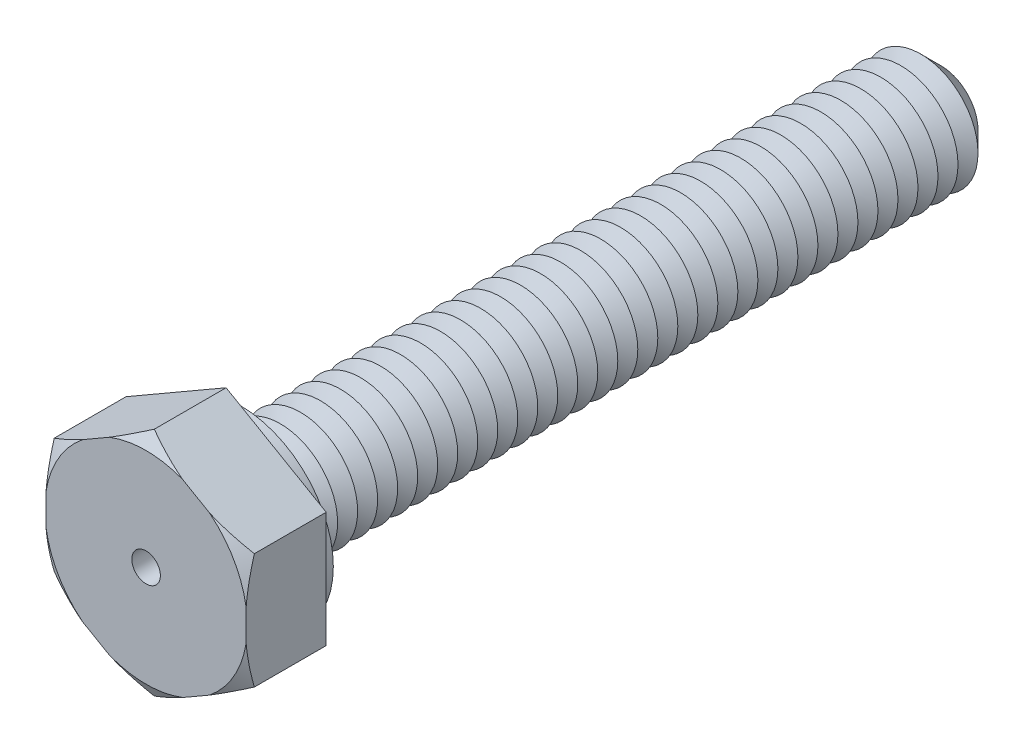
ISO-10303-21;
HEADER;
FILE_DESCRIPTION(('STEP AP214'),'2;1');
FILE_NAME('part.step','',(''),(''),'','','');
FILE_SCHEMA(('AUTOMOTIVE_DESIGN { 1 0 10303 214 1 1 1 1 }'));
ENDSEC;
DATA;
#1=APPLICATION_CONTEXT('core data for automotive mechanical design processes');
#2=APPLICATION_PROTOCOL_DEFINITION('international standard','automotive_design',2000,#1);
#3=PRODUCT_CONTEXT('',#1,'mechanical');
#4=PRODUCT('Part','Part','',(#3));
#5=PRODUCT_RELATED_PRODUCT_CATEGORY('part','',(#4));
#6=PRODUCT_DEFINITION_FORMATION('','',#4);
#7=PRODUCT_DEFINITION_CONTEXT('part definition',#1,'design');
#8=PRODUCT_DEFINITION('design','',#6,#7);
#9=PRODUCT_DEFINITION_SHAPE('','',#8);
#10=(LENGTH_UNIT() NAMED_UNIT(*) SI_UNIT(.MILLI.,.METRE.));
#11=(NAMED_UNIT(*) PLANE_ANGLE_UNIT() SI_UNIT($,.RADIAN.));
#12=(NAMED_UNIT(*) SI_UNIT($,.STERADIAN.) SOLID_ANGLE_UNIT());
#13=UNCERTAINTY_MEASURE_WITH_UNIT(LENGTH_MEASURE(1.E-05),#10,'distance_accuracy_value','');
#14=(GEOMETRIC_REPRESENTATION_CONTEXT(3) GLOBAL_UNCERTAINTY_ASSIGNED_CONTEXT((#13)) GLOBAL_UNIT_ASSIGNED_CONTEXT((#10,
#11,#12)) REPRESENTATION_CONTEXT('',''));
#15=CARTESIAN_POINT('',(0.,0.,0.));
#16=DIRECTION('',(0.,0.,1.));
#17=DIRECTION('',(1.,0.,0.));
#18=AXIS2_PLACEMENT_3D('',#15,#16,#17);
#19=CARTESIAN_POINT('',(3.5,2.02072594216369,2.8));
#20=DIRECTION('',(-0.5,-0.866025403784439,0.));
#21=DIRECTION('',(0.866025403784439,-0.5,0.));
#22=AXIS2_PLACEMENT_3D('',#19,#20,#21);
#23=PLANE('',#22);
#24=CARTESIAN_POINT('',(5.93124915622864,0.617043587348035,1.40176894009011));
#25=CARTESIAN_POINT('',(5.82127624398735,0.680536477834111,1.46111507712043));
#26=CARTESIAN_POINT('',(5.71104026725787,0.744181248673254,1.51982121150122));
#27=CARTESIAN_POINT('',(5.48993126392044,0.871838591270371,1.63565294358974));
#28=CARTESIAN_POINT('',(5.37905815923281,0.935851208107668,1.69277834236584));
#29=CARTESIAN_POINT('',(5.15623473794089,1.06449837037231,1.80531321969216));
#30=CARTESIAN_POINT('',(5.04428210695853,1.12913425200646,1.86071660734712));
#31=CARTESIAN_POINT('',(4.81953834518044,1.25889012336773,1.96920237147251));
#32=CARTESIAN_POINT('',(4.70674724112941,1.32401009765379,2.02228482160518));
#33=CARTESIAN_POINT('',(4.4773029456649,1.45647982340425,2.12693843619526));
#34=CARTESIAN_POINT('',(4.3606246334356,1.52384407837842,2.17843650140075));
#35=CARTESIAN_POINT('',(4.12610336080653,1.65924499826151,2.27776074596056));
#36=CARTESIAN_POINT('',(4.00826046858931,1.72728162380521,2.32558713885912));
#37=CARTESIAN_POINT('',(3.77136592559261,1.86405275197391,2.41666718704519));
#38=CARTESIAN_POINT('',(3.65231548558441,1.93278655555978,2.45992500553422));
#39=CARTESIAN_POINT('',(3.41281068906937,2.07106471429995,2.54086522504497));
#40=CARTESIAN_POINT('',(3.29235651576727,2.14060896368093,2.57854834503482));
#41=CARTESIAN_POINT('',(3.00433211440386,2.30689992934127,2.66006219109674));
#42=CARTESIAN_POINT('',(2.83610127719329,2.40402804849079,2.70086381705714));
#43=CARTESIAN_POINT('',(2.49725085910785,2.59966342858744,2.76622673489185));
#44=CARTESIAN_POINT('',(2.32663213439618,2.69817019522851,2.79079370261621));
#45=CARTESIAN_POINT('',(2.07079150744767,2.84587985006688,2.81342200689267));
#46=CARTESIAN_POINT('',(1.98601608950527,2.89482496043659,2.8186046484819));
#47=CARTESIAN_POINT('',(1.81634230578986,2.9927861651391,2.82423615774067));
#48=CARTESIAN_POINT('',(1.73144394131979,3.04180225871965,2.82468507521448));
#49=CARTESIAN_POINT('',(1.56172682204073,3.13978848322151,2.82082792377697));
#50=CARTESIAN_POINT('',(1.47690807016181,3.18875861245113,2.81652168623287));
#51=CARTESIAN_POINT('',(1.30753953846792,3.28654357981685,2.80328667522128));
#52=CARTESIAN_POINT('',(1.22298977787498,3.3353584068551,2.79435757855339));
#53=CARTESIAN_POINT('',(1.02330750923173,3.45064501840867,2.76803629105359));
#54=CARTESIAN_POINT('',(0.90836188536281,3.51700890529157,2.7487394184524));
#55=CARTESIAN_POINT('',(0.679569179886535,3.64910243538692,2.70286231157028));
#56=CARTESIAN_POINT('',(0.565722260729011,3.71483198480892,2.67628101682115));
#57=CARTESIAN_POINT('',(0.339141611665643,3.84564838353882,2.61683846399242));
#58=CARTESIAN_POINT('',(0.226409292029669,3.91073441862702,2.58397011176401));
#59=CARTESIAN_POINT('',(0.00220965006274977,4.04017614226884,2.512988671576));
#60=CARTESIAN_POINT('',(-0.109257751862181,4.10453187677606,2.47487591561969));
#61=CARTESIAN_POINT('',(-0.332327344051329,4.23332116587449,2.39383232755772));
#62=CARTESIAN_POINT('',(-0.443915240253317,4.29774646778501,2.35084938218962));
#63=CARTESIAN_POINT('',(-0.665905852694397,4.42591280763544,2.26126522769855));
#64=CARTESIAN_POINT('',(-0.776309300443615,4.48965426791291,2.2146664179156));
#65=CARTESIAN_POINT('',(-1.10600622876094,4.68000487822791,2.07044134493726));
#66=CARTESIAN_POINT('',(-1.32384189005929,4.80577235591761,1.96836549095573));
#67=CARTESIAN_POINT('',(-1.61545494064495,4.97413522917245,1.82536950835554));
#68=CARTESIAN_POINT('',(-1.69056073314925,5.01749757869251,1.78796601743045));
#69=CARTESIAN_POINT('',(-1.84044297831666,5.10403213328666,1.71229146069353));
#70=CARTESIAN_POINT('',(-1.91521944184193,5.14720434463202,1.67402042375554));
#71=CARTESIAN_POINT('',(-2.06368614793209,5.23292163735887,1.59712633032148));
#72=CARTESIAN_POINT('',(-2.13737951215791,5.27546852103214,1.55851128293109));
#73=CARTESIAN_POINT('',(-2.28450431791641,5.36041106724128,1.48061736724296));
#74=CARTESIAN_POINT('',(-2.35793575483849,5.40280672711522,1.44133848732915));
#75=CARTESIAN_POINT('',(-2.43124915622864,5.44513423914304,1.40176894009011));
#76=B_SPLINE_CURVE_WITH_KNOTS('',3,(#24,#25,#26,#27,#28,#29,#30,#31,#32,#33,#34,#35,#36,#37,#38,
#39,#40,#41,#42,#43,#44,#45,#46,#47,#48,#49,#50,#51,#52,#53,#54,#55,#56,#57,#58,#59,#60,#61,#62,
#63,#64,#65,#66,#67,#68,#69,#70,#71,#72,#73,#74,#75),.UNSPECIFIED.,.F.,.F.,(4,2,2,2,2,2,2,2,2,2,
2,2,2,2,2,2,2,2,2,2,2,2,2,2,2,4),(0.,0.420511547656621,0.841075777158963,1.26298883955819,
1.68488850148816,2.11755106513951,2.55018844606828,2.98242811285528,3.41461198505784,
4.0095520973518,4.60428410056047,4.89826759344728,5.19224799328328,5.48623881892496,
5.78025020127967,6.1823765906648,6.58456155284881,6.98720303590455,7.3898190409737,
7.7972442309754,8.20440134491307,9.01851321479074,9.30185450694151,9.58518638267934,
9.86552040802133,10.1458593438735),.UNSPECIFIED.);
#77=CARTESIAN_POINT('',(3.5,2.02072594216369,2.51132486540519));
#78=VERTEX_POINT('',#77);
#79=CARTESIAN_POINT('',(2.2178793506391,2.76095864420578,2.8));
#80=VERTEX_POINT('',#79);
#81=EDGE_CURVE('E132',#78,#80,#76,.T.);
#82=ORIENTED_EDGE('',*,*,#81,.F.);
#83=DIRECTION('',(0.,0.,-1.));
#84=VECTOR('',#83,1.);
#85=CARTESIAN_POINT('',(3.5,2.02072594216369,2.8));
#86=LINE('',#85,#84);
#87=CARTESIAN_POINT('',(3.5,2.02072594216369,0.));
#88=VERTEX_POINT('',#87);
#89=EDGE_CURVE('E144',#78,#88,#86,.T.);
#90=ORIENTED_EDGE('',*,*,#89,.T.);
#91=DIRECTION('',(-0.866025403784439,0.5,0.));
#92=VECTOR('',#91,1.);
#93=CARTESIAN_POINT('',(3.5,2.02072594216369,0.));
#94=LINE('',#93,#92);
#95=CARTESIAN_POINT('',(0.,4.04145188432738,0.));
#96=VERTEX_POINT('',#95);
#97=EDGE_CURVE('E240',#88,#96,#94,.T.);
#98=ORIENTED_EDGE('',*,*,#97,.T.);
#99=DIRECTION('',(0.,0.,-1.));
#100=VECTOR('',#99,1.);
#101=CARTESIAN_POINT('',(0.,4.04145188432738,2.8));
#102=LINE('',#101,#100);
#103=CARTESIAN_POINT('',(0.,4.04145188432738,2.51132486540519));
#104=VERTEX_POINT('',#103);
#105=EDGE_CURVE('E179',#104,#96,#102,.T.);
#106=ORIENTED_EDGE('',*,*,#105,.F.);
#107=CARTESIAN_POINT('',(1.2821206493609,3.30121918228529,2.8));
#108=VERTEX_POINT('',#107);
#109=EDGE_CURVE('E151',#108,#104,#76,.T.);
#110=ORIENTED_EDGE('',*,*,#109,.F.);
#111=DIRECTION('',(-0.866025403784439,0.5,0.));
#112=VECTOR('',#111,1.);
#113=CARTESIAN_POINT('',(3.5,2.02072594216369,2.8));
#114=LINE('',#113,#112);
#115=EDGE_CURVE('E148',#80,#108,#114,.T.);
#116=ORIENTED_EDGE('',*,*,#115,.F.);
#117=EDGE_LOOP('',(#82,#90,#98,#106,#110,#116));
#118=FACE_BOUND('',#117,.T.);
#119=ADVANCED_FACE('F39',(#118),#23,.F.);
#120=CARTESIAN_POINT('',(0.,4.04145188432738,2.8));
#121=DIRECTION('',(0.5,-0.866025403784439,0.));
#122=DIRECTION('',(0.866025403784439,0.5,0.));
#123=AXIS2_PLACEMENT_3D('',#120,#121,#122);
#124=PLANE('',#123);
#125=CARTESIAN_POINT('',(2.43124915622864,5.44513423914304,1.4017689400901));
#126=CARTESIAN_POINT('',(2.32127624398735,5.38164134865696,1.46111507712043));
#127=CARTESIAN_POINT('',(2.21104026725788,5.31799657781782,1.51982121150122));
#128=CARTESIAN_POINT('',(1.98993126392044,5.1903392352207,1.63565294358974));
#129=CARTESIAN_POINT('',(1.87905815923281,5.1263266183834,1.69277834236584));
#130=CARTESIAN_POINT('',(1.65623473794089,4.99767945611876,1.80531321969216));
#131=CARTESIAN_POINT('',(1.54428210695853,4.93304357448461,1.86071660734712));
#132=CARTESIAN_POINT('',(1.31953834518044,4.80328770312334,1.96920237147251));
#133=CARTESIAN_POINT('',(1.20674724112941,4.73816772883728,2.02228482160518));
#134=CARTESIAN_POINT('',(0.977302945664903,4.60569800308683,2.12693843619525));
#135=CARTESIAN_POINT('',(0.860624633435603,4.53833374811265,2.17843650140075));
#136=CARTESIAN_POINT('',(0.626103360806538,4.40293282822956,2.27776074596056));
#137=CARTESIAN_POINT('',(0.50826046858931,4.33489620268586,2.32558713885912));
#138=CARTESIAN_POINT('',(0.271365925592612,4.19812507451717,2.41666718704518));
#139=CARTESIAN_POINT('',(0.152315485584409,4.12939127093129,2.45992500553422));
#140=CARTESIAN_POINT('',(-0.0871893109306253,3.99111311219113,2.54086522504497));
#141=CARTESIAN_POINT('',(-0.207643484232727,3.92156886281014,2.57854834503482));
#142=CARTESIAN_POINT('',(-0.495667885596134,3.7552778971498,2.66006219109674));
#143=CARTESIAN_POINT('',(-0.663898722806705,3.65814977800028,2.70086381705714));
#144=CARTESIAN_POINT('',(-1.00274914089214,3.46251439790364,2.76622673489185));
#145=CARTESIAN_POINT('',(-1.17336786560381,3.36400763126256,2.79079370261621));
#146=CARTESIAN_POINT('',(-1.42920849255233,3.21629797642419,2.81342200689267));
#147=CARTESIAN_POINT('',(-1.51398391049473,3.16735286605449,2.8186046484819));
#148=CARTESIAN_POINT('',(-1.68365769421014,3.06939166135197,2.82423615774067));
#149=CARTESIAN_POINT('',(-1.7685560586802,3.02037556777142,2.82468507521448));
#150=CARTESIAN_POINT('',(-1.93827317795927,2.92238934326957,2.82082792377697));
#151=CARTESIAN_POINT('',(-2.02309192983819,2.87341921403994,2.81652168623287));
#152=CARTESIAN_POINT('',(-2.19246046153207,2.77563424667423,2.80328667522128));
#153=CARTESIAN_POINT('',(-2.27701022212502,2.72681941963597,2.79435757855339));
#154=CARTESIAN_POINT('',(-2.47669249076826,2.6115328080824,2.76803629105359));
#155=CARTESIAN_POINT('',(-2.59163811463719,2.54516892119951,2.7487394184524));
#156=CARTESIAN_POINT('',(-2.82043082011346,2.41307539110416,2.70286231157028));
#157=CARTESIAN_POINT('',(-2.93427773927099,2.34734584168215,2.67628101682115));
#158=CARTESIAN_POINT('',(-3.16085838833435,2.21652944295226,2.61683846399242));
#159=CARTESIAN_POINT('',(-3.27359070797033,2.15144340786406,2.58397011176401));
#160=CARTESIAN_POINT('',(-3.49779034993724,2.02200168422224,2.512988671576));
#161=CARTESIAN_POINT('',(-3.60925775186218,1.95764594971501,2.47487591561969));
#162=CARTESIAN_POINT('',(-3.83232734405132,1.82885666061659,2.39383232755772));
#163=CARTESIAN_POINT('',(-3.94391524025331,1.76443135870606,2.35084938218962));
#164=CARTESIAN_POINT('',(-4.16590585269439,1.63626501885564,2.26126522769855));
#165=CARTESIAN_POINT('',(-4.27630930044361,1.57252355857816,2.21466641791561));
#166=CARTESIAN_POINT('',(-4.60600622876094,1.38217294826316,2.07044134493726));
#167=CARTESIAN_POINT('',(-4.82384189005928,1.25640547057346,1.96836549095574));
#168=CARTESIAN_POINT('',(-5.11545494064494,1.08804259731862,1.82536950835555));
#169=CARTESIAN_POINT('',(-5.19056073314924,1.04468024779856,1.78796601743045));
#170=CARTESIAN_POINT('',(-5.34044297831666,0.958145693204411,1.71229146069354));
#171=CARTESIAN_POINT('',(-5.41521944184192,0.914973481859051,1.67402042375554));
#172=CARTESIAN_POINT('',(-5.56368614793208,0.829256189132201,1.59712633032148));
#173=CARTESIAN_POINT('',(-5.6373795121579,0.786709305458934,1.55851128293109));
#174=CARTESIAN_POINT('',(-5.78450431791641,0.701766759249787,1.48061736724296));
#175=CARTESIAN_POINT('',(-5.85793575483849,0.659371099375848,1.44133848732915));
#176=CARTESIAN_POINT('',(-5.93124915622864,0.617043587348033,1.40176894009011));
#177=B_SPLINE_CURVE_WITH_KNOTS('',3,(#125,#126,#127,#128,#129,#130,#131,#132,#133,#134,#135,
#136,#137,#138,#139,#140,#141,#142,#143,#144,#145,#146,#147,#148,#149,#150,#151,#152,#153,#154,
#155,#156,#157,#158,#159,#160,#161,#162,#163,#164,#165,#166,#167,#168,#169,#170,#171,#172,#173,
#174,#175,#176),.UNSPECIFIED.,.F.,.F.,(4,2,2,2,2,2,2,2,2,2,2,2,2,2,2,2,2,2,2,2,2,2,2,2,2,4),(0.,
0.420511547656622,0.841075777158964,1.26298883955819,1.68488850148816,2.11755106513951,
2.55018844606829,2.98242811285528,3.41461198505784,4.0095520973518,4.60428410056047,
4.89826759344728,5.19224799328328,5.48623881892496,5.78025020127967,6.1823765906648,
6.58456155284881,6.98720303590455,7.3898190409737,7.7972442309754,8.20440134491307,
9.01851321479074,9.30185450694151,9.58518638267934,9.86552040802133,10.1458593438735),.UNSPECIFIED.);
#178=CARTESIAN_POINT('',(-1.2821206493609,3.30121918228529,2.8));
#179=VERTEX_POINT('',#178);
#180=EDGE_CURVE('E543',#104,#179,#177,.T.);
#181=ORIENTED_EDGE('',*,*,#180,.F.);
#182=ORIENTED_EDGE('',*,*,#105,.T.);
#183=DIRECTION('',(-0.866025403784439,-0.5,0.));
#184=VECTOR('',#183,1.);
#185=CARTESIAN_POINT('',(0.,4.04145188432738,0.));
#186=LINE('',#185,#184);
#187=CARTESIAN_POINT('',(-3.5,2.02072594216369,0.));
#188=VERTEX_POINT('',#187);
#189=EDGE_CURVE('E242',#96,#188,#186,.T.);
#190=ORIENTED_EDGE('',*,*,#189,.T.);
#191=DIRECTION('',(0.,0.,-1.));
#192=VECTOR('',#191,1.);
#193=CARTESIAN_POINT('',(-3.5,2.02072594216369,2.8));
#194=LINE('',#193,#192);
#195=CARTESIAN_POINT('',(-3.5,2.02072594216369,2.51132486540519));
#196=VERTEX_POINT('',#195);
#197=EDGE_CURVE('E176',#196,#188,#194,.T.);
#198=ORIENTED_EDGE('',*,*,#197,.F.);
#199=CARTESIAN_POINT('',(-2.2178793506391,2.76095864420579,2.8));
#200=VERTEX_POINT('',#199);
#201=EDGE_CURVE('E535',#200,#196,#177,.T.);
#202=ORIENTED_EDGE('',*,*,#201,.F.);
#203=DIRECTION('',(-0.866025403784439,-0.5,0.));
#204=VECTOR('',#203,1.);
#205=CARTESIAN_POINT('',(0.,4.04145188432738,2.8));
#206=LINE('',#205,#204);
#207=EDGE_CURVE('E216',#179,#200,#206,.T.);
#208=ORIENTED_EDGE('',*,*,#207,.F.);
#209=EDGE_LOOP('',(#181,#182,#190,#198,#202,#208));
#210=FACE_BOUND('',#209,.T.);
#211=ADVANCED_FACE('F549',(#210),#124,.F.);
#212=CARTESIAN_POINT('',(-3.5,2.02072594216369,2.8));
#213=DIRECTION('',(1.,0.,0.));
#214=DIRECTION('',(0.,1.,0.));
#215=AXIS2_PLACEMENT_3D('',#212,#213,#214);
#216=PLANE('',#215);
#217=CARTESIAN_POINT('',(-3.5,4.45197509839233,1.57509745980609));
#218=CARTESIAN_POINT('',(-3.5,4.32552348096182,1.632476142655));
#219=CARTESIAN_POINT('',(-3.5,4.19872625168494,1.68910722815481));
#220=CARTESIAN_POINT('',(-3.5,3.94429210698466,1.80051165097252));
#221=CARTESIAN_POINT('',(-3.5,3.81665504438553,1.85528465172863));
#222=CARTESIAN_POINT('',(-3.5,3.55990351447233,1.96281335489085));
#223=CARTESIAN_POINT('',(-3.5,3.43078510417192,2.01555968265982));
#224=CARTESIAN_POINT('',(-3.5,3.17145843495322,2.11829034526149));
#225=CARTESIAN_POINT('',(-3.5,3.04125022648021,2.16827480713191));
#226=CARTESIAN_POINT('',(-3.5,2.78016103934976,2.26465408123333));
#227=CARTESIAN_POINT('',(-3.5,2.64928566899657,2.31106393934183));
#228=CARTESIAN_POINT('',(-3.5,2.38615329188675,2.39977727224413));
#229=CARTESIAN_POINT('',(-3.5,2.25389619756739,2.44208048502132));
#230=CARTESIAN_POINT('',(-3.5,1.85519063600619,2.56138283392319));
#231=CARTESIAN_POINT('',(-3.5,1.58637912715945,2.63093897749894));
#232=CARTESIAN_POINT('',(-3.5,1.11975855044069,2.72563856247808));
#233=CARTESIAN_POINT('',(-3.5,0.923391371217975,2.75778053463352));
#234=CARTESIAN_POINT('',(-3.5,0.528527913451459,2.80406409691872));
#235=CARTESIAN_POINT('',(-3.5,0.330032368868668,2.81821170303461));
#236=CARTESIAN_POINT('',(-3.5,-0.0672968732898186,2.82680706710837));
#237=CARTESIAN_POINT('',(-3.5,-0.266130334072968,2.82126532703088));
#238=CARTESIAN_POINT('',(-3.5,-0.662321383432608,2.79120496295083));
#239=CARTESIAN_POINT('',(-3.5,-0.859678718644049,2.76668315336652));
#240=CARTESIAN_POINT('',(-3.5,-1.34971804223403,2.68500356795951));
#241=CARTESIAN_POINT('',(-3.5,-1.64068160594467,2.61765497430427));
#242=CARTESIAN_POINT('',(-3.5,-2.07181303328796,2.497569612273));
#243=CARTESIAN_POINT('',(-3.5,-2.21482517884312,2.45429352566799));
#244=CARTESIAN_POINT('',(-3.5,-2.49919378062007,2.36258423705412));
#245=CARTESIAN_POINT('',(-3.5,-2.64055035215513,2.31415139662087));
#246=CARTESIAN_POINT('',(-3.5,-2.92337235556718,2.2125676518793));
#247=CARTESIAN_POINT('',(-3.5,-3.06482042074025,2.15936898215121));
#248=CARTESIAN_POINT('',(-3.5,-3.34639535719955,2.04956763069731));
#249=CARTESIAN_POINT('',(-3.5,-3.48652214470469,1.99296473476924));
#250=CARTESIAN_POINT('',(-3.5,-3.76476497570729,1.87738368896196));
#251=CARTESIAN_POINT('',(-3.5,-3.90288810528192,1.81842250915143));
#252=CARTESIAN_POINT('',(-3.5,-4.1781332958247,1.6982956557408));
#253=CARTESIAN_POINT('',(-3.5,-4.31525559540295,1.6371305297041));
#254=CARTESIAN_POINT('',(-3.5,-4.45197509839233,1.57509745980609));
#255=B_SPLINE_CURVE_WITH_KNOTS('',3,(#217,#218,#219,#220,#221,#222,#223,#224,#225,#226,#227,
#228,#229,#230,#231,#232,#233,#234,#235,#236,#237,#238,#239,#240,#241,#242,#243,#244,#245,#246,
#247,#248,#249,#250,#251,#252,#253,#254),.UNSPECIFIED.,.F.,.F.,(4,2,2,2,2,2,2,2,2,2,2,2,2,2,2,2,
2,2,4),(0.,0.416588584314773,0.83325222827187,1.251655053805,1.67003861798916,2.08655215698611,
2.50309225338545,3.3347974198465,3.93106101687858,4.52712521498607,5.12287153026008,
5.71871785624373,6.61272902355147,7.06093271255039,7.50910499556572,7.9624204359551,
8.41576442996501,8.86628772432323,9.31669984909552),.UNSPECIFIED.);
#256=CARTESIAN_POINT('',(-3.5,0.540260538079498,2.8));
#257=VERTEX_POINT('',#256);
#258=EDGE_CURVE('E223',#196,#257,#255,.T.);
#259=ORIENTED_EDGE('',*,*,#258,.F.);
#260=ORIENTED_EDGE('',*,*,#197,.T.);
#261=DIRECTION('',(0.,-1.,0.));
#262=VECTOR('',#261,1.);
#263=CARTESIAN_POINT('',(-3.5,2.02072594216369,0.));
#264=LINE('',#263,#262);
#265=CARTESIAN_POINT('',(-3.5,-2.02072594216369,0.));
#266=VERTEX_POINT('',#265);
#267=EDGE_CURVE('E247',#188,#266,#264,.T.);
#268=ORIENTED_EDGE('',*,*,#267,.T.);
#269=DIRECTION('',(0.,0.,-1.));
#270=VECTOR('',#269,1.);
#271=CARTESIAN_POINT('',(-3.5,-2.02072594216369,2.8));
#272=LINE('',#271,#270);
#273=CARTESIAN_POINT('',(-3.5,-2.02072594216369,2.51132486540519));
#274=VERTEX_POINT('',#273);
#275=EDGE_CURVE('E173',#274,#266,#272,.T.);
#276=ORIENTED_EDGE('',*,*,#275,.F.);
#277=CARTESIAN_POINT('',(-3.5,-0.540260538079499,2.8));
#278=VERTEX_POINT('',#277);
#279=EDGE_CURVE('E226',#278,#274,#255,.T.);
#280=ORIENTED_EDGE('',*,*,#279,.F.);
#281=DIRECTION('',(0.,-1.,0.));
#282=VECTOR('',#281,1.);
#283=CARTESIAN_POINT('',(-3.5,2.02072594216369,2.8));
#284=LINE('',#283,#282);
#285=EDGE_CURVE('E214',#257,#278,#284,.T.);
#286=ORIENTED_EDGE('',*,*,#285,.F.);
#287=EDGE_LOOP('',(#259,#260,#268,#276,#280,#286));
#288=FACE_BOUND('',#287,.T.);
#289=ADVANCED_FACE('F222',(#288),#216,.F.);
#290=CARTESIAN_POINT('',(-3.5,-2.02072594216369,2.8));
#291=DIRECTION('',(0.5,0.866025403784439,0.));
#292=DIRECTION('',(-0.866025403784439,0.5,0.));
#293=AXIS2_PLACEMENT_3D('',#290,#291,#292);
#294=PLANE('',#293);
#295=CARTESIAN_POINT('',(-5.93124915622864,-0.617043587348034,1.4017689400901));
#296=CARTESIAN_POINT('',(-5.82127624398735,-0.68053647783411,1.46111507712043));
#297=CARTESIAN_POINT('',(-5.71104026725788,-0.744181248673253,1.51982121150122));
#298=CARTESIAN_POINT('',(-5.48993126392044,-0.87183859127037,1.63565294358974));
#299=CARTESIAN_POINT('',(-5.37905815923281,-0.935851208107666,1.69277834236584));
#300=CARTESIAN_POINT('',(-5.15623473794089,-1.06449837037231,1.80531321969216));
#301=CARTESIAN_POINT('',(-5.04428210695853,-1.12913425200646,1.86071660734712));
#302=CARTESIAN_POINT('',(-4.81953834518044,-1.25889012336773,1.96920237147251));
#303=CARTESIAN_POINT('',(-4.70674724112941,-1.32401009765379,2.02228482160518));
#304=CARTESIAN_POINT('',(-4.4773029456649,-1.45647982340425,2.12693843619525));
#305=CARTESIAN_POINT('',(-4.3606246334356,-1.52384407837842,2.17843650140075));
#306=CARTESIAN_POINT('',(-4.12610336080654,-1.65924499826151,2.27776074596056));
#307=CARTESIAN_POINT('',(-4.00826046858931,-1.72728162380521,2.32558713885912));
#308=CARTESIAN_POINT('',(-3.77136592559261,-1.8640527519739,2.41666718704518));
#309=CARTESIAN_POINT('',(-3.65231548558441,-1.93278655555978,2.45992500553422));
#310=CARTESIAN_POINT('',(-3.41281068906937,-2.07106471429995,2.54086522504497));
#311=CARTESIAN_POINT('',(-3.29235651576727,-2.14060896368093,2.57854834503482));
#312=CARTESIAN_POINT('',(-3.00433211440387,-2.30689992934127,2.66006219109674));
#313=CARTESIAN_POINT('',(-2.83610127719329,-2.40402804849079,2.70086381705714));
#314=CARTESIAN_POINT('',(-2.49725085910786,-2.59966342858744,2.76622673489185));
#315=CARTESIAN_POINT('',(-2.32663213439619,-2.69817019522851,2.79079370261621));
#316=CARTESIAN_POINT('',(-2.07079150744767,-2.84587985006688,2.81342200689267));
#317=CARTESIAN_POINT('',(-1.98601608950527,-2.89482496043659,2.8186046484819));
#318=CARTESIAN_POINT('',(-1.81634230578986,-2.9927861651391,2.82423615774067));
#319=CARTESIAN_POINT('',(-1.7314439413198,-3.04180225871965,2.82468507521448));
#320=CARTESIAN_POINT('',(-1.56172682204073,-3.13978848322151,2.82082792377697));
#321=CARTESIAN_POINT('',(-1.47690807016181,-3.18875861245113,2.81652168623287));
#322=CARTESIAN_POINT('',(-1.30753953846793,-3.28654357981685,2.80328667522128));
#323=CARTESIAN_POINT('',(-1.22298977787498,-3.3353584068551,2.79435757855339));
#324=CARTESIAN_POINT('',(-1.02330750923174,-3.45064501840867,2.76803629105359));
#325=CARTESIAN_POINT('',(-0.908361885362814,-3.51700890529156,2.7487394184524));
#326=CARTESIAN_POINT('',(-0.679569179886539,-3.64910243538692,2.70286231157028));
#327=CARTESIAN_POINT('',(-0.565722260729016,-3.71483198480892,2.67628101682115));
#328=CARTESIAN_POINT('',(-0.339141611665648,-3.84564838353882,2.61683846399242));
#329=CARTESIAN_POINT('',(-0.226409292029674,-3.91073441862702,2.58397011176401));
#330=CARTESIAN_POINT('',(-0.00220965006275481,-4.04017614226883,2.512988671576));
#331=CARTESIAN_POINT('',(0.109257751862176,-4.10453187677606,2.47487591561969));
#332=CARTESIAN_POINT('',(0.332327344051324,-4.23332116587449,2.39383232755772));
#333=CARTESIAN_POINT('',(0.443915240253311,-4.29774646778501,2.35084938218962));
#334=CARTESIAN_POINT('',(0.665905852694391,-4.42591280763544,2.26126522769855));
#335=CARTESIAN_POINT('',(0.776309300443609,-4.48965426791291,2.2146664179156));
#336=CARTESIAN_POINT('',(1.10600622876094,-4.68000487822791,2.07044134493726));
#337=CARTESIAN_POINT('',(1.32384189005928,-4.80577235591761,1.96836549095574));
#338=CARTESIAN_POINT('',(1.61545494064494,-4.97413522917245,1.82536950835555));
#339=CARTESIAN_POINT('',(1.69056073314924,-5.01749757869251,1.78796601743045));
#340=CARTESIAN_POINT('',(1.84044297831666,-5.10403213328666,1.71229146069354));
#341=CARTESIAN_POINT('',(1.91521944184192,-5.14720434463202,1.67402042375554));
#342=CARTESIAN_POINT('',(2.06368614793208,-5.23292163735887,1.59712633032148));
#343=CARTESIAN_POINT('',(2.1373795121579,-5.27546852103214,1.55851128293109));
#344=CARTESIAN_POINT('',(2.28450431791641,-5.36041106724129,1.48061736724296));
#345=CARTESIAN_POINT('',(2.35793575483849,-5.40280672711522,1.44133848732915));
#346=CARTESIAN_POINT('',(2.43124915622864,-5.44513423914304,1.40176894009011));
#347=B_SPLINE_CURVE_WITH_KNOTS('',3,(#295,#296,#297,#298,#299,#300,#301,#302,#303,#304,#305,
#306,#307,#308,#309,#310,#311,#312,#313,#314,#315,#316,#317,#318,#319,#320,#321,#322,#323,#324,
#325,#326,#327,#328,#329,#330,#331,#332,#333,#334,#335,#336,#337,#338,#339,#340,#341,#342,#343,
#344,#345,#346),.UNSPECIFIED.,.F.,.F.,(4,2,2,2,2,2,2,2,2,2,2,2,2,2,2,2,2,2,2,2,2,2,2,2,2,4),(0.,
0.420511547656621,0.841075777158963,1.26298883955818,1.68488850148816,2.11755106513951,
2.55018844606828,2.98242811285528,3.41461198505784,4.00955209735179,4.60428410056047,
4.89826759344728,5.19224799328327,5.48623881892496,5.78025020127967,6.1823765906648,
6.58456155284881,6.98720303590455,7.38981904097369,7.7972442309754,8.20440134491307,
9.01851321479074,9.30185450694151,9.58518638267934,9.86552040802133,10.1458593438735),.UNSPECIFIED.);
#348=CARTESIAN_POINT('',(-2.2178793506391,-2.76095864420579,2.8));
#349=VERTEX_POINT('',#348);
#350=EDGE_CURVE('E586',#274,#349,#347,.T.);
#351=ORIENTED_EDGE('',*,*,#350,.F.);
#352=ORIENTED_EDGE('',*,*,#275,.T.);
#353=DIRECTION('',(0.866025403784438,-0.5,0.));
#354=VECTOR('',#353,1.);
#355=CARTESIAN_POINT('',(-3.5,-2.02072594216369,0.));
#356=LINE('',#355,#354);
#357=CARTESIAN_POINT('',(0.,-4.04145188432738,0.));
#358=VERTEX_POINT('',#357);
#359=EDGE_CURVE('E251',#266,#358,#356,.T.);
#360=ORIENTED_EDGE('',*,*,#359,.T.);
#361=DIRECTION('',(0.,0.,-1.));
#362=VECTOR('',#361,1.);
#363=CARTESIAN_POINT('',(0.,-4.04145188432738,2.8));
#364=LINE('',#363,#362);
#365=CARTESIAN_POINT('',(0.,-4.04145188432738,2.51132486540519));
#366=VERTEX_POINT('',#365);
#367=EDGE_CURVE('E163',#366,#358,#364,.T.);
#368=ORIENTED_EDGE('',*,*,#367,.F.);
#369=CARTESIAN_POINT('',(-1.2821206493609,-3.30121918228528,2.8));
#370=VERTEX_POINT('',#369);
#371=EDGE_CURVE('E580',#370,#366,#347,.T.);
#372=ORIENTED_EDGE('',*,*,#371,.F.);
#373=DIRECTION('',(0.866025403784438,-0.5,0.));
#374=VECTOR('',#373,1.);
#375=CARTESIAN_POINT('',(-3.5,-2.02072594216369,2.8));
#376=LINE('',#375,#374);
#377=EDGE_CURVE('E228',#349,#370,#376,.T.);
#378=ORIENTED_EDGE('',*,*,#377,.F.);
#379=EDGE_LOOP('',(#351,#352,#360,#368,#372,#378));
#380=FACE_BOUND('',#379,.T.);
#381=ADVANCED_FACE('F587',(#380),#294,.F.);
#382=CARTESIAN_POINT('',(0.,-4.04145188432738,2.8));
#383=DIRECTION('',(-0.5,0.866025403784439,0.));
#384=DIRECTION('',(-0.866025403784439,-0.5,0.));
#385=AXIS2_PLACEMENT_3D('',#382,#383,#384);
#386=PLANE('',#385);
#387=CARTESIAN_POINT('',(-2.43124915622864,-5.44513423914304,1.4017689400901));
#388=CARTESIAN_POINT('',(-2.32127624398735,-5.38164134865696,1.46111507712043));
#389=CARTESIAN_POINT('',(-2.21104026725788,-5.31799657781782,1.51982121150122));
#390=CARTESIAN_POINT('',(-1.98993126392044,-5.1903392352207,1.63565294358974));
#391=CARTESIAN_POINT('',(-1.87905815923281,-5.1263266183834,1.69277834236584));
#392=CARTESIAN_POINT('',(-1.65623473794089,-4.99767945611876,1.80531321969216));
#393=CARTESIAN_POINT('',(-1.54428210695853,-4.93304357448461,1.86071660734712));
#394=CARTESIAN_POINT('',(-1.31953834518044,-4.80328770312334,1.96920237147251));
#395=CARTESIAN_POINT('',(-1.20674724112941,-4.73816772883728,2.02228482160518));
#396=CARTESIAN_POINT('',(-0.977302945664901,-4.60569800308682,2.12693843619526));
#397=CARTESIAN_POINT('',(-0.860624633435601,-4.53833374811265,2.17843650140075));
#398=CARTESIAN_POINT('',(-0.626103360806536,-4.40293282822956,2.27776074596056));
#399=CARTESIAN_POINT('',(-0.508260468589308,-4.33489620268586,2.32558713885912));
#400=CARTESIAN_POINT('',(-0.27136592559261,-4.19812507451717,2.41666718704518));
#401=CARTESIAN_POINT('',(-0.152315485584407,-4.12939127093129,2.45992500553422));
#402=CARTESIAN_POINT('',(0.0871893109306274,-3.99111311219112,2.54086522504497));
#403=CARTESIAN_POINT('',(0.20764348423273,-3.92156886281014,2.57854834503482));
#404=CARTESIAN_POINT('',(0.495667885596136,-3.7552778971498,2.66006219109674));
#405=CARTESIAN_POINT('',(0.663898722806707,-3.65814977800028,2.70086381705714));
#406=CARTESIAN_POINT('',(1.00274914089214,-3.46251439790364,2.76622673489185));
#407=CARTESIAN_POINT('',(1.17336786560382,-3.36400763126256,2.79079370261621));
#408=CARTESIAN_POINT('',(1.42920849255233,-3.21629797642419,2.81342200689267));
#409=CARTESIAN_POINT('',(1.51398391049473,-3.16735286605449,2.8186046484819));
#410=CARTESIAN_POINT('',(1.68365769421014,-3.06939166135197,2.82423615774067));
#411=CARTESIAN_POINT('',(1.76855605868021,-3.02037556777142,2.82468507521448));
#412=CARTESIAN_POINT('',(1.93827317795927,-2.92238934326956,2.82082792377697));
#413=CARTESIAN_POINT('',(2.02309192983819,-2.87341921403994,2.81652168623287));
#414=CARTESIAN_POINT('',(2.19246046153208,-2.77563424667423,2.80328667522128));
#415=CARTESIAN_POINT('',(2.27701022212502,-2.72681941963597,2.79435757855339));
#416=CARTESIAN_POINT('',(2.47669249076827,-2.6115328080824,2.76803629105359));
#417=CARTESIAN_POINT('',(2.59163811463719,-2.54516892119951,2.7487394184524));
#418=CARTESIAN_POINT('',(2.82043082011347,-2.41307539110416,2.70286231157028));
#419=CARTESIAN_POINT('',(2.93427773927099,-2.34734584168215,2.67628101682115));
#420=CARTESIAN_POINT('',(3.16085838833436,-2.21652944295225,2.61683846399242));
#421=CARTESIAN_POINT('',(3.27359070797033,-2.15144340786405,2.58397011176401));
#422=CARTESIAN_POINT('',(3.49779034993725,-2.02200168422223,2.512988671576));
#423=CARTESIAN_POINT('',(3.60925775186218,-1.95764594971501,2.47487591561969));
#424=CARTESIAN_POINT('',(3.83232734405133,-1.82885666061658,2.39383232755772));
#425=CARTESIAN_POINT('',(3.94391524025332,-1.76443135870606,2.35084938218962));
#426=CARTESIAN_POINT('',(4.1659058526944,-1.63626501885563,2.26126522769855));
#427=CARTESIAN_POINT('',(4.27630930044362,-1.57252355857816,2.2146664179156));
#428=CARTESIAN_POINT('',(4.60600622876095,-1.38217294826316,2.07044134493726));
#429=CARTESIAN_POINT('',(4.82384189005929,-1.25640547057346,1.96836549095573));
#430=CARTESIAN_POINT('',(5.11545494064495,-1.08804259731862,1.82536950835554));
#431=CARTESIAN_POINT('',(5.19056073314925,-1.04468024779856,1.78796601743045));
#432=CARTESIAN_POINT('',(5.34044297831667,-0.95814569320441,1.71229146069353));
#433=CARTESIAN_POINT('',(5.41521944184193,-0.914973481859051,1.67402042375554));
#434=CARTESIAN_POINT('',(5.56368614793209,-0.829256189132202,1.59712633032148));
#435=CARTESIAN_POINT('',(5.63737951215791,-0.786709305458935,1.55851128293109));
#436=CARTESIAN_POINT('',(5.78450431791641,-0.70176675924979,1.48061736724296));
#437=CARTESIAN_POINT('',(5.85793575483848,-0.659371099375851,1.44133848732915));
#438=CARTESIAN_POINT('',(5.93124915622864,-0.617043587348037,1.40176894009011));
#439=B_SPLINE_CURVE_WITH_KNOTS('',3,(#387,#388,#389,#390,#391,#392,#393,#394,#395,#396,#397,
#398,#399,#400,#401,#402,#403,#404,#405,#406,#407,#408,#409,#410,#411,#412,#413,#414,#415,#416,
#417,#418,#419,#420,#421,#422,#423,#424,#425,#426,#427,#428,#429,#430,#431,#432,#433,#434,#435,
#436,#437,#438),.UNSPECIFIED.,.F.,.F.,(4,2,2,2,2,2,2,2,2,2,2,2,2,2,2,2,2,2,2,2,2,2,2,2,2,4),(0.,
0.420511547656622,0.841075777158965,1.26298883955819,1.68488850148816,2.11755106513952,
2.55018844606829,2.98242811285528,3.41461198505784,4.0095520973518,4.60428410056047,
4.89826759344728,5.19224799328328,5.48623881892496,5.78025020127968,6.18237659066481,
6.58456155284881,6.98720303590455,7.3898190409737,7.79724423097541,8.20440134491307,
9.01851321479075,9.30185450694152,9.58518638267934,9.86552040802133,10.1458593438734),.UNSPECIFIED.);
#440=CARTESIAN_POINT('',(1.2821206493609,-3.30121918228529,2.8));
#441=VERTEX_POINT('',#440);
#442=EDGE_CURVE('E64',#366,#441,#439,.T.);
#443=ORIENTED_EDGE('',*,*,#442,.F.);
#444=ORIENTED_EDGE('',*,*,#367,.T.);
#445=DIRECTION('',(0.866025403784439,0.5,0.));
#446=VECTOR('',#445,1.);
#447=CARTESIAN_POINT('',(0.,-4.04145188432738,0.));
#448=LINE('',#447,#446);
#449=CARTESIAN_POINT('',(3.5,-2.02072594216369,0.));
#450=VERTEX_POINT('',#449);
#451=EDGE_CURVE('E254',#358,#450,#448,.T.);
#452=ORIENTED_EDGE('',*,*,#451,.T.);
#453=DIRECTION('',(0.,0.,-1.));
#454=VECTOR('',#453,1.);
#455=CARTESIAN_POINT('',(3.5,-2.02072594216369,2.8));
#456=LINE('',#455,#454);
#457=CARTESIAN_POINT('',(3.5,-2.02072594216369,2.51132486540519));
#458=VERTEX_POINT('',#457);
#459=EDGE_CURVE('E157',#458,#450,#456,.T.);
#460=ORIENTED_EDGE('',*,*,#459,.F.);
#461=CARTESIAN_POINT('',(2.2178793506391,-2.76095864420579,2.8));
#462=VERTEX_POINT('',#461);
#463=EDGE_CURVE('E575',#462,#458,#439,.T.);
#464=ORIENTED_EDGE('',*,*,#463,.F.);
#465=DIRECTION('',(0.866025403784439,0.5,0.));
#466=VECTOR('',#465,1.);
#467=CARTESIAN_POINT('',(0.,-4.04145188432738,2.8));
#468=LINE('',#467,#466);
#469=EDGE_CURVE('E166',#441,#462,#468,.T.);
#470=ORIENTED_EDGE('',*,*,#469,.F.);
#471=EDGE_LOOP('',(#443,#444,#452,#460,#464,#470));
#472=FACE_BOUND('',#471,.T.);
#473=ADVANCED_FACE('F590',(#472),#386,.F.);
#474=CARTESIAN_POINT('',(3.5,-2.02072594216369,2.8));
#475=DIRECTION('',(-1.,0.,0.));
#476=DIRECTION('',(0.,-1.,0.));
#477=AXIS2_PLACEMENT_3D('',#474,#475,#476);
#478=PLANE('',#477);
#479=CARTESIAN_POINT('',(3.5,-4.45197509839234,1.57509745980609));
#480=CARTESIAN_POINT('',(3.5,-4.32552348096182,1.632476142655));
#481=CARTESIAN_POINT('',(3.5,-4.19872625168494,1.68910722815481));
#482=CARTESIAN_POINT('',(3.5,-3.94429210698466,1.80051165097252));
#483=CARTESIAN_POINT('',(3.5,-3.81665504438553,1.85528465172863));
#484=CARTESIAN_POINT('',(3.5,-3.55990351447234,1.96281335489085));
#485=CARTESIAN_POINT('',(3.5,-3.43078510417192,2.01555968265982));
#486=CARTESIAN_POINT('',(3.5,-3.17145843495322,2.11829034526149));
#487=CARTESIAN_POINT('',(3.5,-3.04125022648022,2.16827480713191));
#488=CARTESIAN_POINT('',(3.5,-2.78016103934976,2.26465408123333));
#489=CARTESIAN_POINT('',(3.5,-2.64928566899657,2.31106393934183));
#490=CARTESIAN_POINT('',(3.5,-2.38615329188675,2.39977727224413));
#491=CARTESIAN_POINT('',(3.5,-2.25389619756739,2.44208048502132));
#492=CARTESIAN_POINT('',(3.5,-1.85519063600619,2.56138283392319));
#493=CARTESIAN_POINT('',(3.5,-1.58637912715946,2.63093897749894));
#494=CARTESIAN_POINT('',(3.5,-1.11975855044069,2.72563856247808));
#495=CARTESIAN_POINT('',(3.5,-0.923391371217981,2.75778053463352));
#496=CARTESIAN_POINT('',(3.5,-0.528527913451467,2.80406409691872));
#497=CARTESIAN_POINT('',(3.5,-0.330032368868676,2.81821170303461));
#498=CARTESIAN_POINT('',(3.5,0.0672968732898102,2.82680706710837));
#499=CARTESIAN_POINT('',(3.5,0.26613033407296,2.82126532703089));
#500=CARTESIAN_POINT('',(3.5,0.662321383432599,2.79120496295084));
#501=CARTESIAN_POINT('',(3.5,0.85967871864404,2.76668315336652));
#502=CARTESIAN_POINT('',(3.5,1.34971804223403,2.68500356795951));
#503=CARTESIAN_POINT('',(3.5,1.64068160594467,2.61765497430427));
#504=CARTESIAN_POINT('',(3.5,2.07181303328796,2.497569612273));
#505=CARTESIAN_POINT('',(3.5,2.21482517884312,2.45429352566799));
#506=CARTESIAN_POINT('',(3.5,2.49919378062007,2.36258423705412));
#507=CARTESIAN_POINT('',(3.5,2.64055035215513,2.31415139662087));
#508=CARTESIAN_POINT('',(3.5,2.92337235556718,2.2125676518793));
#509=CARTESIAN_POINT('',(3.5,3.06482042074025,2.15936898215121));
#510=CARTESIAN_POINT('',(3.5,3.34639535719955,2.04956763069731));
#511=CARTESIAN_POINT('',(3.5,3.48652214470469,1.99296473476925));
#512=CARTESIAN_POINT('',(3.5,3.76476497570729,1.87738368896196));
#513=CARTESIAN_POINT('',(3.5,3.90288810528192,1.81842250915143));
#514=CARTESIAN_POINT('',(3.5,4.1781332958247,1.6982956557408));
#515=CARTESIAN_POINT('',(3.5,4.31525559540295,1.6371305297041));
#516=CARTESIAN_POINT('',(3.5,4.45197509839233,1.57509745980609));
#517=B_SPLINE_CURVE_WITH_KNOTS('',3,(#479,#480,#481,#482,#483,#484,#485,#486,#487,#488,#489,
#490,#491,#492,#493,#494,#495,#496,#497,#498,#499,#500,#501,#502,#503,#504,#505,#506,#507,#508,
#509,#510,#511,#512,#513,#514,#515,#516),.UNSPECIFIED.,.F.,.F.,(4,2,2,2,2,2,2,2,2,2,2,2,2,2,2,2,
2,2,4),(0.,0.416588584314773,0.83325222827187,1.251655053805,1.67003861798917,2.08655215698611,
2.50309225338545,3.33479741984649,3.93106101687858,4.52712521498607,5.12287153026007,
5.71871785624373,6.61272902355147,7.0609327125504,7.50910499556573,7.96242043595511,
8.41576442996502,8.86628772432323,9.31669984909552),.UNSPECIFIED.);
#518=CARTESIAN_POINT('',(3.5,-0.540260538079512,2.8));
#519=VERTEX_POINT('',#518);
#520=EDGE_CURVE('E56',#458,#519,#517,.T.);
#521=ORIENTED_EDGE('',*,*,#520,.F.);
#522=ORIENTED_EDGE('',*,*,#459,.T.);
#523=DIRECTION('',(0.,1.,0.));
#524=VECTOR('',#523,1.);
#525=CARTESIAN_POINT('',(3.5,-2.02072594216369,0.));
#526=LINE('',#525,#524);
#527=EDGE_CURVE('E154',#450,#88,#526,.T.);
#528=ORIENTED_EDGE('',*,*,#527,.T.);
#529=ORIENTED_EDGE('',*,*,#89,.F.);
#530=CARTESIAN_POINT('',(3.5,0.540260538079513,2.8));
#531=VERTEX_POINT('',#530);
#532=EDGE_CURVE('E129',#531,#78,#517,.T.);
#533=ORIENTED_EDGE('',*,*,#532,.F.);
#534=DIRECTION('',(0.,1.,0.));
#535=VECTOR('',#534,1.);
#536=CARTESIAN_POINT('',(3.5,-2.02072594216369,2.8));
#537=LINE('',#536,#535);
#538=EDGE_CURVE('E158',#519,#531,#537,.T.);
#539=ORIENTED_EDGE('',*,*,#538,.F.);
#540=EDGE_LOOP('',(#521,#522,#528,#529,#533,#539));
#541=FACE_BOUND('',#540,.T.);
#542=ADVANCED_FACE('F152',(#541),#478,.F.);
#543=CARTESIAN_POINT('',(0.,0.,2.8));
#544=DIRECTION('',(0.,0.,1.));
#545=DIRECTION('',(1.,0.,0.));
#546=AXIS2_PLACEMENT_3D('',#543,#544,#545);
#547=PLANE('',#546);
#548=CARTESIAN_POINT('',(0.,0.,2.8));
#549=DIRECTION('',(0.,0.,1.));
#550=DIRECTION('',(1.,0.,0.));
#551=AXIS2_PLACEMENT_3D('',#548,#549,#550);
#552=CIRCLE('',#551,0.5);
#553=CARTESIAN_POINT('',(0.5,0.,2.8));
#554=VERTEX_POINT('',#553);
#555=EDGE_CURVE('E1514',#554,#554,#552,.T.);
#556=ORIENTED_EDGE('',*,*,#555,.F.);
#557=EDGE_LOOP('',(#556));
#558=FACE_BOUND('',#557,.T.);
#559=ORIENTED_EDGE('',*,*,#538,.T.);
#560=CARTESIAN_POINT('',(0.,0.,2.8));
#561=DIRECTION('',(0.,0.,1.));
#562=DIRECTION('',(1.,0.,0.));
#563=AXIS2_PLACEMENT_3D('',#560,#561,#562);
#564=CIRCLE('',#563,3.54145188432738);
#565=EDGE_CURVE('E134',#531,#80,#564,.T.);
#566=ORIENTED_EDGE('',*,*,#565,.T.);
#567=ORIENTED_EDGE('',*,*,#115,.T.);
#568=CARTESIAN_POINT('',(0.,0.,2.8));
#569=DIRECTION('',(0.,0.,1.));
#570=DIRECTION('',(1.,0.,0.));
#571=AXIS2_PLACEMENT_3D('',#568,#569,#570);
#572=CIRCLE('',#571,3.54145188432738);
#573=EDGE_CURVE('E11',#108,#179,#572,.T.);
#574=ORIENTED_EDGE('',*,*,#573,.T.);
#575=ORIENTED_EDGE('',*,*,#207,.T.);
#576=EDGE_CURVE('E49',#200,#257,#572,.T.);
#577=ORIENTED_EDGE('',*,*,#576,.T.);
#578=ORIENTED_EDGE('',*,*,#285,.T.);
#579=EDGE_CURVE('E199',#278,#349,#572,.T.);
#580=ORIENTED_EDGE('',*,*,#579,.T.);
#581=ORIENTED_EDGE('',*,*,#377,.T.);
#582=EDGE_CURVE('E193',#370,#441,#572,.T.);
#583=ORIENTED_EDGE('',*,*,#582,.T.);
#584=ORIENTED_EDGE('',*,*,#469,.T.);
#585=EDGE_CURVE('E43',#462,#519,#572,.T.);
#586=ORIENTED_EDGE('',*,*,#585,.T.);
#587=EDGE_LOOP('',(#559,#566,#567,#574,#575,#577,#578,#580,#581,#583,#584,#586));
#588=FACE_BOUND('',#587,.T.);
#589=ADVANCED_FACE('F213',(#558,#588),#547,.T.);
#590=CARTESIAN_POINT('',(0.,0.,0.));
#591=DIRECTION('',(0.,0.,1.));
#592=DIRECTION('',(1.,0.,0.));
#593=AXIS2_PLACEMENT_3D('',#590,#591,#592);
#594=PLANE('',#593);
#595=CARTESIAN_POINT('',(0.,0.,0.));
#596=DIRECTION('',(0.,0.,1.));
#597=DIRECTION('',(1.,0.,0.));
#598=AXIS2_PLACEMENT_3D('',#595,#596,#597);
#599=CIRCLE('',#598,3.25);
#600=CARTESIAN_POINT('',(3.25,0.,0.));
#601=VERTEX_POINT('',#600);
#602=EDGE_CURVE('E182',#601,#601,#599,.F.);
#603=ORIENTED_EDGE('',*,*,#602,.F.);
#604=EDGE_LOOP('',(#603));
#605=FACE_BOUND('',#604,.T.);
#606=ORIENTED_EDGE('',*,*,#97,.F.);
#607=ORIENTED_EDGE('',*,*,#527,.F.);
#608=ORIENTED_EDGE('',*,*,#451,.F.);
#609=ORIENTED_EDGE('',*,*,#359,.F.);
#610=ORIENTED_EDGE('',*,*,#267,.F.);
#611=ORIENTED_EDGE('',*,*,#189,.F.);
#612=EDGE_LOOP('',(#606,#607,#608,#609,#610,#611));
#613=FACE_BOUND('',#612,.T.);
#614=ADVANCED_FACE('F634',(#605,#613),#594,.F.);
#615=CARTESIAN_POINT('',(0.,0.,-0.5));
#616=DIRECTION('',(0.,0.,1.));
#617=DIRECTION('',(1.,0.,0.));
#618=AXIS2_PLACEMENT_3D('',#615,#616,#617);
#619=CYLINDRICAL_SURFACE('',#618,3.25);
#620=CARTESIAN_POINT('',(0.,0.,-0.5));
#621=DIRECTION('',(0.,0.,-1.));
#622=DIRECTION('',(-1.,0.,0.));
#623=AXIS2_PLACEMENT_3D('',#620,#621,#622);
#624=CIRCLE('',#623,3.25);
#625=CARTESIAN_POINT('',(-3.25,0.,-0.5));
#626=VERTEX_POINT('',#625);
#627=EDGE_CURVE('E243',#626,#626,#624,.T.);
#628=ORIENTED_EDGE('',*,*,#627,.F.);
#629=EDGE_LOOP('',(#628));
#630=FACE_BOUND('',#629,.T.);
#631=ORIENTED_EDGE('',*,*,#602,.T.);
#632=EDGE_LOOP('',(#631));
#633=FACE_BOUND('',#632,.T.);
#634=ADVANCED_FACE('F645',(#630,#633),#619,.T.);
#635=CARTESIAN_POINT('',(0.,0.,-0.5));
#636=DIRECTION('',(0.,0.,-1.));
#637=DIRECTION('',(-1.,0.,0.));
#638=AXIS2_PLACEMENT_3D('',#635,#636,#637);
#639=PLANE('',#638);
#640=CARTESIAN_POINT('',(0.,0.,-0.5));
#641=DIRECTION('',(0.,0.,1.));
#642=DIRECTION('',(1.,0.,0.));
#643=AXIS2_PLACEMENT_3D('',#640,#641,#642);
#644=CIRCLE('',#643,2.);
#645=CARTESIAN_POINT('',(2.,0.,-0.5));
#646=VERTEX_POINT('',#645);
#647=EDGE_CURVE('E267',#646,#646,#644,.T.);
#648=ORIENTED_EDGE('',*,*,#647,.T.);
#649=EDGE_LOOP('',(#648));
#650=FACE_BOUND('',#649,.T.);
#651=ORIENTED_EDGE('',*,*,#627,.T.);
#652=EDGE_LOOP('',(#651));
#653=FACE_BOUND('',#652,.T.);
#654=ADVANCED_FACE('F654',(#650,#653),#639,.T.);
#655=CARTESIAN_POINT('',(0.,0.,-0.5));
#656=DIRECTION('',(0.,0.,1.));
#657=DIRECTION('',(1.,0.,0.));
#658=AXIS2_PLACEMENT_3D('',#655,#656,#657);
#659=CONICAL_SURFACE('',#658,2.,1.0471975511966);
#660=CARTESIAN_POINT('',(0.,0.,-0.85));
#661=DIRECTION('',(0.,0.,1.));
#662=DIRECTION('',(1.,0.,0.));
#663=AXIS2_PLACEMENT_3D('',#660,#661,#662);
#664=CIRCLE('',#663,1.39378221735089);
#665=CARTESIAN_POINT('',(1.39378221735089,0.,-0.85));
#666=VERTEX_POINT('',#665);
#667=EDGE_CURVE('E271',#666,#666,#664,.T.);
#668=ORIENTED_EDGE('',*,*,#667,.T.);
#669=EDGE_LOOP('',(#668));
#670=FACE_BOUND('',#669,.T.);
#671=ORIENTED_EDGE('',*,*,#647,.F.);
#672=EDGE_LOOP('',(#671));
#673=FACE_BOUND('',#672,.T.);
#674=ADVANCED_FACE('F663',(#670,#673),#659,.T.);
#675=CARTESIAN_POINT('',(0.,0.,-0.85));
#676=DIRECTION('',(0.,0.,-1.));
#677=DIRECTION('',(-1.,0.,0.));
#678=AXIS2_PLACEMENT_3D('',#675,#676,#677);
#679=CONICAL_SURFACE('',#678,1.39378221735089,1.0471975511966);
#680=CARTESIAN_POINT('',(0.,0.,-1.2));
#681=DIRECTION('',(0.,0.,1.));
#682=DIRECTION('',(1.,0.,0.));
#683=AXIS2_PLACEMENT_3D('',#680,#681,#682);
#684=CIRCLE('',#683,2.);
#685=CARTESIAN_POINT('',(2.,0.,-1.2));
#686=VERTEX_POINT('',#685);
#687=EDGE_CURVE('E274',#686,#686,#684,.T.);
#688=ORIENTED_EDGE('',*,*,#687,.T.);
#689=EDGE_LOOP('',(#688));
#690=FACE_BOUND('',#689,.T.);
#691=ORIENTED_EDGE('',*,*,#667,.F.);
#692=EDGE_LOOP('',(#691));
#693=FACE_BOUND('',#692,.T.);
#694=ADVANCED_FACE('F673',(#690,#693),#679,.T.);
#695=CARTESIAN_POINT('',(0.,0.,-1.2));
#696=DIRECTION('',(0.,0.,1.));
#697=DIRECTION('',(1.,0.,0.));
#698=AXIS2_PLACEMENT_3D('',#695,#696,#697);
#699=CONICAL_SURFACE('',#698,2.,1.0471975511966);
#700=CARTESIAN_POINT('',(0.,0.,-1.55));
#701=DIRECTION('',(0.,0.,1.));
#702=DIRECTION('',(1.,0.,0.));
#703=AXIS2_PLACEMENT_3D('',#700,#701,#702);
#704=CIRCLE('',#703,1.39378221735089);
#705=CARTESIAN_POINT('',(1.39378221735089,0.,-1.55));
#706=VERTEX_POINT('',#705);
#707=EDGE_CURVE('E278',#706,#706,#704,.T.);
#708=ORIENTED_EDGE('',*,*,#707,.T.);
#709=EDGE_LOOP('',(#708));
#710=FACE_BOUND('',#709,.T.);
#711=ORIENTED_EDGE('',*,*,#687,.F.);
#712=EDGE_LOOP('',(#711));
#713=FACE_BOUND('',#712,.T.);
#714=ADVANCED_FACE('F682',(#710,#713),#699,.T.);
#715=CARTESIAN_POINT('',(0.,0.,-1.55));
#716=DIRECTION('',(0.,0.,-1.));
#717=DIRECTION('',(-1.,0.,0.));
#718=AXIS2_PLACEMENT_3D('',#715,#716,#717);
#719=CONICAL_SURFACE('',#718,1.39378221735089,1.0471975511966);
#720=CARTESIAN_POINT('',(0.,0.,-1.9));
#721=DIRECTION('',(0.,0.,1.));
#722=DIRECTION('',(1.,0.,0.));
#723=AXIS2_PLACEMENT_3D('',#720,#721,#722);
#724=CIRCLE('',#723,2.);
#725=CARTESIAN_POINT('',(2.,0.,-1.9));
#726=VERTEX_POINT('',#725);
#727=EDGE_CURVE('E282',#726,#726,#724,.T.);
#728=ORIENTED_EDGE('',*,*,#727,.T.);
#729=EDGE_LOOP('',(#728));
#730=FACE_BOUND('',#729,.T.);
#731=ORIENTED_EDGE('',*,*,#707,.F.);
#732=EDGE_LOOP('',(#731));
#733=FACE_BOUND('',#732,.T.);
#734=ADVANCED_FACE('F691',(#730,#733),#719,.T.);
#735=CARTESIAN_POINT('',(0.,0.,-1.9));
#736=DIRECTION('',(0.,0.,1.));
#737=DIRECTION('',(1.,0.,0.));
#738=AXIS2_PLACEMENT_3D('',#735,#736,#737);
#739=CONICAL_SURFACE('',#738,2.,1.0471975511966);
#740=CARTESIAN_POINT('',(0.,0.,-2.25));
#741=DIRECTION('',(0.,0.,1.));
#742=DIRECTION('',(1.,0.,0.));
#743=AXIS2_PLACEMENT_3D('',#740,#741,#742);
#744=CIRCLE('',#743,1.39378221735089);
#745=CARTESIAN_POINT('',(1.39378221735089,0.,-2.25));
#746=VERTEX_POINT('',#745);
#747=EDGE_CURVE('E286',#746,#746,#744,.T.);
#748=ORIENTED_EDGE('',*,*,#747,.T.);
#749=EDGE_LOOP('',(#748));
#750=FACE_BOUND('',#749,.T.);
#751=ORIENTED_EDGE('',*,*,#727,.F.);
#752=EDGE_LOOP('',(#751));
#753=FACE_BOUND('',#752,.T.);
#754=ADVANCED_FACE('F700',(#750,#753),#739,.T.);
#755=CARTESIAN_POINT('',(0.,0.,-2.25));
#756=DIRECTION('',(0.,0.,-1.));
#757=DIRECTION('',(-1.,0.,0.));
#758=AXIS2_PLACEMENT_3D('',#755,#756,#757);
#759=CONICAL_SURFACE('',#758,1.39378221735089,1.0471975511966);
#760=CARTESIAN_POINT('',(0.,0.,-2.6));
#761=DIRECTION('',(0.,0.,1.));
#762=DIRECTION('',(1.,0.,0.));
#763=AXIS2_PLACEMENT_3D('',#760,#761,#762);
#764=CIRCLE('',#763,2.);
#765=CARTESIAN_POINT('',(2.,0.,-2.6));
#766=VERTEX_POINT('',#765);
#767=EDGE_CURVE('E290',#766,#766,#764,.T.);
#768=ORIENTED_EDGE('',*,*,#767,.T.);
#769=EDGE_LOOP('',(#768));
#770=FACE_BOUND('',#769,.T.);
#771=ORIENTED_EDGE('',*,*,#747,.F.);
#772=EDGE_LOOP('',(#771));
#773=FACE_BOUND('',#772,.T.);
#774=ADVANCED_FACE('F709',(#770,#773),#759,.T.);
#775=CARTESIAN_POINT('',(0.,0.,-2.6));
#776=DIRECTION('',(0.,0.,1.));
#777=DIRECTION('',(1.,0.,0.));
#778=AXIS2_PLACEMENT_3D('',#775,#776,#777);
#779=CONICAL_SURFACE('',#778,2.,1.0471975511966);
#780=CARTESIAN_POINT('',(0.,0.,-2.95));
#781=DIRECTION('',(0.,0.,1.));
#782=DIRECTION('',(1.,0.,0.));
#783=AXIS2_PLACEMENT_3D('',#780,#781,#782);
#784=CIRCLE('',#783,1.39378221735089);
#785=CARTESIAN_POINT('',(1.39378221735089,0.,-2.95));
#786=VERTEX_POINT('',#785);
#787=EDGE_CURVE('E294',#786,#786,#784,.T.);
#788=ORIENTED_EDGE('',*,*,#787,.T.);
#789=EDGE_LOOP('',(#788));
#790=FACE_BOUND('',#789,.T.);
#791=ORIENTED_EDGE('',*,*,#767,.F.);
#792=EDGE_LOOP('',(#791));
#793=FACE_BOUND('',#792,.T.);
#794=ADVANCED_FACE('F718',(#790,#793),#779,.T.);
#795=CARTESIAN_POINT('',(0.,0.,-2.95));
#796=DIRECTION('',(0.,0.,-1.));
#797=DIRECTION('',(-1.,0.,0.));
#798=AXIS2_PLACEMENT_3D('',#795,#796,#797);
#799=CONICAL_SURFACE('',#798,1.39378221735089,1.0471975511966);
#800=CARTESIAN_POINT('',(0.,0.,-3.3));
#801=DIRECTION('',(0.,0.,1.));
#802=DIRECTION('',(1.,0.,0.));
#803=AXIS2_PLACEMENT_3D('',#800,#801,#802);
#804=CIRCLE('',#803,2.);
#805=CARTESIAN_POINT('',(2.,0.,-3.3));
#806=VERTEX_POINT('',#805);
#807=EDGE_CURVE('E298',#806,#806,#804,.T.);
#808=ORIENTED_EDGE('',*,*,#807,.T.);
#809=EDGE_LOOP('',(#808));
#810=FACE_BOUND('',#809,.T.);
#811=ORIENTED_EDGE('',*,*,#787,.F.);
#812=EDGE_LOOP('',(#811));
#813=FACE_BOUND('',#812,.T.);
#814=ADVANCED_FACE('F727',(#810,#813),#799,.T.);
#815=CARTESIAN_POINT('',(0.,0.,-3.3));
#816=DIRECTION('',(0.,0.,1.));
#817=DIRECTION('',(1.,0.,0.));
#818=AXIS2_PLACEMENT_3D('',#815,#816,#817);
#819=CONICAL_SURFACE('',#818,2.,1.0471975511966);
#820=CARTESIAN_POINT('',(0.,0.,-3.65));
#821=DIRECTION('',(0.,0.,1.));
#822=DIRECTION('',(1.,0.,0.));
#823=AXIS2_PLACEMENT_3D('',#820,#821,#822);
#824=CIRCLE('',#823,1.39378221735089);
#825=CARTESIAN_POINT('',(1.39378221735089,0.,-3.65));
#826=VERTEX_POINT('',#825);
#827=EDGE_CURVE('E301',#826,#826,#824,.T.);
#828=ORIENTED_EDGE('',*,*,#827,.T.);
#829=EDGE_LOOP('',(#828));
#830=FACE_BOUND('',#829,.T.);
#831=ORIENTED_EDGE('',*,*,#807,.F.);
#832=EDGE_LOOP('',(#831));
#833=FACE_BOUND('',#832,.T.);
#834=ADVANCED_FACE('F736',(#830,#833),#819,.T.);
#835=CARTESIAN_POINT('',(0.,0.,-3.65));
#836=DIRECTION('',(0.,0.,-1.));
#837=DIRECTION('',(-1.,0.,0.));
#838=AXIS2_PLACEMENT_3D('',#835,#836,#837);
#839=CONICAL_SURFACE('',#838,1.39378221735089,1.0471975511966);
#840=CARTESIAN_POINT('',(0.,0.,-4.));
#841=DIRECTION('',(0.,0.,1.));
#842=DIRECTION('',(1.,0.,0.));
#843=AXIS2_PLACEMENT_3D('',#840,#841,#842);
#844=CIRCLE('',#843,2.);
#845=CARTESIAN_POINT('',(2.,0.,-4.));
#846=VERTEX_POINT('',#845);
#847=EDGE_CURVE('E304',#846,#846,#844,.T.);
#848=ORIENTED_EDGE('',*,*,#847,.T.);
#849=EDGE_LOOP('',(#848));
#850=FACE_BOUND('',#849,.T.);
#851=ORIENTED_EDGE('',*,*,#827,.F.);
#852=EDGE_LOOP('',(#851));
#853=FACE_BOUND('',#852,.T.);
#854=ADVANCED_FACE('F745',(#850,#853),#839,.T.);
#855=CARTESIAN_POINT('',(0.,0.,-4.));
#856=DIRECTION('',(0.,0.,1.));
#857=DIRECTION('',(1.,0.,0.));
#858=AXIS2_PLACEMENT_3D('',#855,#856,#857);
#859=CONICAL_SURFACE('',#858,2.,1.0471975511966);
#860=CARTESIAN_POINT('',(0.,0.,-4.35));
#861=DIRECTION('',(0.,0.,1.));
#862=DIRECTION('',(1.,0.,0.));
#863=AXIS2_PLACEMENT_3D('',#860,#861,#862);
#864=CIRCLE('',#863,1.39378221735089);
#865=CARTESIAN_POINT('',(1.39378221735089,0.,-4.35));
#866=VERTEX_POINT('',#865);
#867=EDGE_CURVE('E307',#866,#866,#864,.T.);
#868=ORIENTED_EDGE('',*,*,#867,.T.);
#869=EDGE_LOOP('',(#868));
#870=FACE_BOUND('',#869,.T.);
#871=ORIENTED_EDGE('',*,*,#847,.F.);
#872=EDGE_LOOP('',(#871));
#873=FACE_BOUND('',#872,.T.);
#874=ADVANCED_FACE('F754',(#870,#873),#859,.T.);
#875=CARTESIAN_POINT('',(0.,0.,-4.35));
#876=DIRECTION('',(0.,0.,-1.));
#877=DIRECTION('',(-1.,0.,0.));
#878=AXIS2_PLACEMENT_3D('',#875,#876,#877);
#879=CONICAL_SURFACE('',#878,1.39378221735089,1.0471975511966);
#880=CARTESIAN_POINT('',(0.,0.,-4.7));
#881=DIRECTION('',(0.,0.,1.));
#882=DIRECTION('',(1.,0.,0.));
#883=AXIS2_PLACEMENT_3D('',#880,#881,#882);
#884=CIRCLE('',#883,2.);
#885=CARTESIAN_POINT('',(2.,0.,-4.7));
#886=VERTEX_POINT('',#885);
#887=EDGE_CURVE('E311',#886,#886,#884,.T.);
#888=ORIENTED_EDGE('',*,*,#887,.T.);
#889=EDGE_LOOP('',(#888));
#890=FACE_BOUND('',#889,.T.);
#891=ORIENTED_EDGE('',*,*,#867,.F.);
#892=EDGE_LOOP('',(#891));
#893=FACE_BOUND('',#892,.T.);
#894=ADVANCED_FACE('F763',(#890,#893),#879,.T.);
#895=CARTESIAN_POINT('',(0.,0.,-4.7));
#896=DIRECTION('',(0.,0.,1.));
#897=DIRECTION('',(1.,0.,0.));
#898=AXIS2_PLACEMENT_3D('',#895,#896,#897);
#899=CONICAL_SURFACE('',#898,2.,1.0471975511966);
#900=CARTESIAN_POINT('',(0.,0.,-5.05));
#901=DIRECTION('',(0.,0.,1.));
#902=DIRECTION('',(1.,0.,0.));
#903=AXIS2_PLACEMENT_3D('',#900,#901,#902);
#904=CIRCLE('',#903,1.39378221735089);
#905=CARTESIAN_POINT('',(1.39378221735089,0.,-5.05));
#906=VERTEX_POINT('',#905);
#907=EDGE_CURVE('E315',#906,#906,#904,.T.);
#908=ORIENTED_EDGE('',*,*,#907,.T.);
#909=EDGE_LOOP('',(#908));
#910=FACE_BOUND('',#909,.T.);
#911=ORIENTED_EDGE('',*,*,#887,.F.);
#912=EDGE_LOOP('',(#911));
#913=FACE_BOUND('',#912,.T.);
#914=ADVANCED_FACE('F772',(#910,#913),#899,.T.);
#915=CARTESIAN_POINT('',(0.,0.,-5.05));
#916=DIRECTION('',(0.,0.,-1.));
#917=DIRECTION('',(-1.,0.,0.));
#918=AXIS2_PLACEMENT_3D('',#915,#916,#917);
#919=CONICAL_SURFACE('',#918,1.39378221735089,1.0471975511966);
#920=CARTESIAN_POINT('',(0.,0.,-5.4));
#921=DIRECTION('',(0.,0.,1.));
#922=DIRECTION('',(1.,0.,0.));
#923=AXIS2_PLACEMENT_3D('',#920,#921,#922);
#924=CIRCLE('',#923,2.);
#925=CARTESIAN_POINT('',(2.,0.,-5.4));
#926=VERTEX_POINT('',#925);
#927=EDGE_CURVE('E319',#926,#926,#924,.T.);
#928=ORIENTED_EDGE('',*,*,#927,.T.);
#929=EDGE_LOOP('',(#928));
#930=FACE_BOUND('',#929,.T.);
#931=ORIENTED_EDGE('',*,*,#907,.F.);
#932=EDGE_LOOP('',(#931));
#933=FACE_BOUND('',#932,.T.);
#934=ADVANCED_FACE('F781',(#930,#933),#919,.T.);
#935=CARTESIAN_POINT('',(0.,0.,-5.4));
#936=DIRECTION('',(0.,0.,1.));
#937=DIRECTION('',(1.,0.,0.));
#938=AXIS2_PLACEMENT_3D('',#935,#936,#937);
#939=CONICAL_SURFACE('',#938,2.,1.0471975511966);
#940=CARTESIAN_POINT('',(0.,0.,-5.75));
#941=DIRECTION('',(0.,0.,1.));
#942=DIRECTION('',(1.,0.,0.));
#943=AXIS2_PLACEMENT_3D('',#940,#941,#942);
#944=CIRCLE('',#943,1.39378221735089);
#945=CARTESIAN_POINT('',(1.39378221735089,0.,-5.75));
#946=VERTEX_POINT('',#945);
#947=EDGE_CURVE('E323',#946,#946,#944,.T.);
#948=ORIENTED_EDGE('',*,*,#947,.T.);
#949=EDGE_LOOP('',(#948));
#950=FACE_BOUND('',#949,.T.);
#951=ORIENTED_EDGE('',*,*,#927,.F.);
#952=EDGE_LOOP('',(#951));
#953=FACE_BOUND('',#952,.T.);
#954=ADVANCED_FACE('F790',(#950,#953),#939,.T.);
#955=CARTESIAN_POINT('',(0.,0.,-5.75));
#956=DIRECTION('',(0.,0.,-1.));
#957=DIRECTION('',(-1.,0.,0.));
#958=AXIS2_PLACEMENT_3D('',#955,#956,#957);
#959=CONICAL_SURFACE('',#958,1.39378221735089,1.0471975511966);
#960=CARTESIAN_POINT('',(0.,0.,-6.1));
#961=DIRECTION('',(0.,0.,1.));
#962=DIRECTION('',(1.,0.,0.));
#963=AXIS2_PLACEMENT_3D('',#960,#961,#962);
#964=CIRCLE('',#963,2.);
#965=CARTESIAN_POINT('',(2.,0.,-6.1));
#966=VERTEX_POINT('',#965);
#967=EDGE_CURVE('E327',#966,#966,#964,.T.);
#968=ORIENTED_EDGE('',*,*,#967,.T.);
#969=EDGE_LOOP('',(#968));
#970=FACE_BOUND('',#969,.T.);
#971=ORIENTED_EDGE('',*,*,#947,.F.);
#972=EDGE_LOOP('',(#971));
#973=FACE_BOUND('',#972,.T.);
#974=ADVANCED_FACE('F799',(#970,#973),#959,.T.);
#975=CARTESIAN_POINT('',(0.,0.,-6.1));
#976=DIRECTION('',(0.,0.,1.));
#977=DIRECTION('',(1.,0.,0.));
#978=AXIS2_PLACEMENT_3D('',#975,#976,#977);
#979=CONICAL_SURFACE('',#978,2.,1.0471975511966);
#980=CARTESIAN_POINT('',(0.,0.,-6.45));
#981=DIRECTION('',(0.,0.,1.));
#982=DIRECTION('',(1.,0.,0.));
#983=AXIS2_PLACEMENT_3D('',#980,#981,#982);
#984=CIRCLE('',#983,1.39378221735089);
#985=CARTESIAN_POINT('',(1.39378221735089,0.,-6.45));
#986=VERTEX_POINT('',#985);
#987=EDGE_CURVE('E331',#986,#986,#984,.T.);
#988=ORIENTED_EDGE('',*,*,#987,.T.);
#989=EDGE_LOOP('',(#988));
#990=FACE_BOUND('',#989,.T.);
#991=ORIENTED_EDGE('',*,*,#967,.F.);
#992=EDGE_LOOP('',(#991));
#993=FACE_BOUND('',#992,.T.);
#994=ADVANCED_FACE('F808',(#990,#993),#979,.T.);
#995=CARTESIAN_POINT('',(0.,0.,-6.45));
#996=DIRECTION('',(0.,0.,-1.));
#997=DIRECTION('',(-1.,0.,0.));
#998=AXIS2_PLACEMENT_3D('',#995,#996,#997);
#999=CONICAL_SURFACE('',#998,1.39378221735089,1.0471975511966);
#1000=CARTESIAN_POINT('',(0.,0.,-6.8));
#1001=DIRECTION('',(0.,0.,1.));
#1002=DIRECTION('',(1.,0.,0.));
#1003=AXIS2_PLACEMENT_3D('',#1000,#1001,#1002);
#1004=CIRCLE('',#1003,2.);
#1005=CARTESIAN_POINT('',(2.,0.,-6.8));
#1006=VERTEX_POINT('',#1005);
#1007=EDGE_CURVE('E335',#1006,#1006,#1004,.T.);
#1008=ORIENTED_EDGE('',*,*,#1007,.T.);
#1009=EDGE_LOOP('',(#1008));
#1010=FACE_BOUND('',#1009,.T.);
#1011=ORIENTED_EDGE('',*,*,#987,.F.);
#1012=EDGE_LOOP('',(#1011));
#1013=FACE_BOUND('',#1012,.T.);
#1014=ADVANCED_FACE('F817',(#1010,#1013),#999,.T.);
#1015=CARTESIAN_POINT('',(0.,0.,-6.8));
#1016=DIRECTION('',(0.,0.,1.));
#1017=DIRECTION('',(1.,0.,0.));
#1018=AXIS2_PLACEMENT_3D('',#1015,#1016,#1017);
#1019=CONICAL_SURFACE('',#1018,2.,1.0471975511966);
#1020=CARTESIAN_POINT('',(0.,0.,-7.15));
#1021=DIRECTION('',(0.,0.,1.));
#1022=DIRECTION('',(1.,0.,0.));
#1023=AXIS2_PLACEMENT_3D('',#1020,#1021,#1022);
#1024=CIRCLE('',#1023,1.39378221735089);
#1025=CARTESIAN_POINT('',(1.39378221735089,0.,-7.15));
#1026=VERTEX_POINT('',#1025);
#1027=EDGE_CURVE('E339',#1026,#1026,#1024,.T.);
#1028=ORIENTED_EDGE('',*,*,#1027,.T.);
#1029=EDGE_LOOP('',(#1028));
#1030=FACE_BOUND('',#1029,.T.);
#1031=ORIENTED_EDGE('',*,*,#1007,.F.);
#1032=EDGE_LOOP('',(#1031));
#1033=FACE_BOUND('',#1032,.T.);
#1034=ADVANCED_FACE('F826',(#1030,#1033),#1019,.T.);
#1035=CARTESIAN_POINT('',(0.,0.,-7.15));
#1036=DIRECTION('',(0.,0.,-1.));
#1037=DIRECTION('',(-1.,0.,0.));
#1038=AXIS2_PLACEMENT_3D('',#1035,#1036,#1037);
#1039=CONICAL_SURFACE('',#1038,1.39378221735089,1.0471975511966);
#1040=CARTESIAN_POINT('',(0.,0.,-7.5));
#1041=DIRECTION('',(0.,0.,1.));
#1042=DIRECTION('',(1.,0.,0.));
#1043=AXIS2_PLACEMENT_3D('',#1040,#1041,#1042);
#1044=CIRCLE('',#1043,2.);
#1045=CARTESIAN_POINT('',(2.,0.,-7.5));
#1046=VERTEX_POINT('',#1045);
#1047=EDGE_CURVE('E343',#1046,#1046,#1044,.T.);
#1048=ORIENTED_EDGE('',*,*,#1047,.T.);
#1049=EDGE_LOOP('',(#1048));
#1050=FACE_BOUND('',#1049,.T.);
#1051=ORIENTED_EDGE('',*,*,#1027,.F.);
#1052=EDGE_LOOP('',(#1051));
#1053=FACE_BOUND('',#1052,.T.);
#1054=ADVANCED_FACE('F835',(#1050,#1053),#1039,.T.);
#1055=CARTESIAN_POINT('',(0.,0.,-7.5));
#1056=DIRECTION('',(0.,0.,1.));
#1057=DIRECTION('',(1.,0.,0.));
#1058=AXIS2_PLACEMENT_3D('',#1055,#1056,#1057);
#1059=CONICAL_SURFACE('',#1058,2.,1.0471975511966);
#1060=CARTESIAN_POINT('',(0.,0.,-7.85));
#1061=DIRECTION('',(0.,0.,1.));
#1062=DIRECTION('',(1.,0.,0.));
#1063=AXIS2_PLACEMENT_3D('',#1060,#1061,#1062);
#1064=CIRCLE('',#1063,1.39378221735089);
#1065=CARTESIAN_POINT('',(1.39378221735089,0.,-7.85));
#1066=VERTEX_POINT('',#1065);
#1067=EDGE_CURVE('E347',#1066,#1066,#1064,.T.);
#1068=ORIENTED_EDGE('',*,*,#1067,.T.);
#1069=EDGE_LOOP('',(#1068));
#1070=FACE_BOUND('',#1069,.T.);
#1071=ORIENTED_EDGE('',*,*,#1047,.F.);
#1072=EDGE_LOOP('',(#1071));
#1073=FACE_BOUND('',#1072,.T.);
#1074=ADVANCED_FACE('F844',(#1070,#1073),#1059,.T.);
#1075=CARTESIAN_POINT('',(0.,0.,-7.85));
#1076=DIRECTION('',(0.,0.,-1.));
#1077=DIRECTION('',(-1.,0.,0.));
#1078=AXIS2_PLACEMENT_3D('',#1075,#1076,#1077);
#1079=CONICAL_SURFACE('',#1078,1.39378221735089,1.0471975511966);
#1080=CARTESIAN_POINT('',(0.,0.,-8.2));
#1081=DIRECTION('',(0.,0.,1.));
#1082=DIRECTION('',(1.,0.,0.));
#1083=AXIS2_PLACEMENT_3D('',#1080,#1081,#1082);
#1084=CIRCLE('',#1083,2.);
#1085=CARTESIAN_POINT('',(2.,0.,-8.2));
#1086=VERTEX_POINT('',#1085);
#1087=EDGE_CURVE('E351',#1086,#1086,#1084,.T.);
#1088=ORIENTED_EDGE('',*,*,#1087,.T.);
#1089=EDGE_LOOP('',(#1088));
#1090=FACE_BOUND('',#1089,.T.);
#1091=ORIENTED_EDGE('',*,*,#1067,.F.);
#1092=EDGE_LOOP('',(#1091));
#1093=FACE_BOUND('',#1092,.T.);
#1094=ADVANCED_FACE('F853',(#1090,#1093),#1079,.T.);
#1095=CARTESIAN_POINT('',(0.,0.,-8.2));
#1096=DIRECTION('',(0.,0.,1.));
#1097=DIRECTION('',(1.,0.,0.));
#1098=AXIS2_PLACEMENT_3D('',#1095,#1096,#1097);
#1099=CONICAL_SURFACE('',#1098,2.,1.0471975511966);
#1100=CARTESIAN_POINT('',(0.,0.,-8.55));
#1101=DIRECTION('',(0.,0.,1.));
#1102=DIRECTION('',(1.,0.,0.));
#1103=AXIS2_PLACEMENT_3D('',#1100,#1101,#1102);
#1104=CIRCLE('',#1103,1.39378221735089);
#1105=CARTESIAN_POINT('',(1.39378221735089,0.,-8.55));
#1106=VERTEX_POINT('',#1105);
#1107=EDGE_CURVE('E355',#1106,#1106,#1104,.T.);
#1108=ORIENTED_EDGE('',*,*,#1107,.T.);
#1109=EDGE_LOOP('',(#1108));
#1110=FACE_BOUND('',#1109,.T.);
#1111=ORIENTED_EDGE('',*,*,#1087,.F.);
#1112=EDGE_LOOP('',(#1111));
#1113=FACE_BOUND('',#1112,.T.);
#1114=ADVANCED_FACE('F862',(#1110,#1113),#1099,.T.);
#1115=CARTESIAN_POINT('',(0.,0.,-8.55));
#1116=DIRECTION('',(0.,0.,-1.));
#1117=DIRECTION('',(-1.,0.,0.));
#1118=AXIS2_PLACEMENT_3D('',#1115,#1116,#1117);
#1119=CONICAL_SURFACE('',#1118,1.39378221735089,1.0471975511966);
#1120=CARTESIAN_POINT('',(0.,0.,-8.9));
#1121=DIRECTION('',(0.,0.,1.));
#1122=DIRECTION('',(1.,0.,0.));
#1123=AXIS2_PLACEMENT_3D('',#1120,#1121,#1122);
#1124=CIRCLE('',#1123,2.);
#1125=CARTESIAN_POINT('',(2.,0.,-8.9));
#1126=VERTEX_POINT('',#1125);
#1127=EDGE_CURVE('E359',#1126,#1126,#1124,.T.);
#1128=ORIENTED_EDGE('',*,*,#1127,.T.);
#1129=EDGE_LOOP('',(#1128));
#1130=FACE_BOUND('',#1129,.T.);
#1131=ORIENTED_EDGE('',*,*,#1107,.F.);
#1132=EDGE_LOOP('',(#1131));
#1133=FACE_BOUND('',#1132,.T.);
#1134=ADVANCED_FACE('F871',(#1130,#1133),#1119,.T.);
#1135=CARTESIAN_POINT('',(0.,0.,-8.9));
#1136=DIRECTION('',(0.,0.,1.));
#1137=DIRECTION('',(1.,0.,0.));
#1138=AXIS2_PLACEMENT_3D('',#1135,#1136,#1137);
#1139=CONICAL_SURFACE('',#1138,2.,1.0471975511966);
#1140=CARTESIAN_POINT('',(0.,0.,-9.25));
#1141=DIRECTION('',(0.,0.,1.));
#1142=DIRECTION('',(1.,0.,0.));
#1143=AXIS2_PLACEMENT_3D('',#1140,#1141,#1142);
#1144=CIRCLE('',#1143,1.39378221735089);
#1145=CARTESIAN_POINT('',(1.39378221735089,0.,-9.25));
#1146=VERTEX_POINT('',#1145);
#1147=EDGE_CURVE('E363',#1146,#1146,#1144,.T.);
#1148=ORIENTED_EDGE('',*,*,#1147,.T.);
#1149=EDGE_LOOP('',(#1148));
#1150=FACE_BOUND('',#1149,.T.);
#1151=ORIENTED_EDGE('',*,*,#1127,.F.);
#1152=EDGE_LOOP('',(#1151));
#1153=FACE_BOUND('',#1152,.T.);
#1154=ADVANCED_FACE('F880',(#1150,#1153),#1139,.T.);
#1155=CARTESIAN_POINT('',(0.,0.,-9.25));
#1156=DIRECTION('',(0.,0.,-1.));
#1157=DIRECTION('',(-1.,0.,0.));
#1158=AXIS2_PLACEMENT_3D('',#1155,#1156,#1157);
#1159=CONICAL_SURFACE('',#1158,1.39378221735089,1.0471975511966);
#1160=CARTESIAN_POINT('',(0.,0.,-9.6));
#1161=DIRECTION('',(0.,0.,1.));
#1162=DIRECTION('',(1.,0.,0.));
#1163=AXIS2_PLACEMENT_3D('',#1160,#1161,#1162);
#1164=CIRCLE('',#1163,2.);
#1165=CARTESIAN_POINT('',(2.,0.,-9.6));
#1166=VERTEX_POINT('',#1165);
#1167=EDGE_CURVE('E367',#1166,#1166,#1164,.T.);
#1168=ORIENTED_EDGE('',*,*,#1167,.T.);
#1169=EDGE_LOOP('',(#1168));
#1170=FACE_BOUND('',#1169,.T.);
#1171=ORIENTED_EDGE('',*,*,#1147,.F.);
#1172=EDGE_LOOP('',(#1171));
#1173=FACE_BOUND('',#1172,.T.);
#1174=ADVANCED_FACE('F889',(#1170,#1173),#1159,.T.);
#1175=CARTESIAN_POINT('',(0.,0.,-9.6));
#1176=DIRECTION('',(0.,0.,1.));
#1177=DIRECTION('',(1.,0.,0.));
#1178=AXIS2_PLACEMENT_3D('',#1175,#1176,#1177);
#1179=CONICAL_SURFACE('',#1178,2.,1.0471975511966);
#1180=CARTESIAN_POINT('',(0.,0.,-9.95));
#1181=DIRECTION('',(0.,0.,1.));
#1182=DIRECTION('',(1.,0.,0.));
#1183=AXIS2_PLACEMENT_3D('',#1180,#1181,#1182);
#1184=CIRCLE('',#1183,1.39378221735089);
#1185=CARTESIAN_POINT('',(1.39378221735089,0.,-9.95));
#1186=VERTEX_POINT('',#1185);
#1187=EDGE_CURVE('E371',#1186,#1186,#1184,.T.);
#1188=ORIENTED_EDGE('',*,*,#1187,.T.);
#1189=EDGE_LOOP('',(#1188));
#1190=FACE_BOUND('',#1189,.T.);
#1191=ORIENTED_EDGE('',*,*,#1167,.F.);
#1192=EDGE_LOOP('',(#1191));
#1193=FACE_BOUND('',#1192,.T.);
#1194=ADVANCED_FACE('F898',(#1190,#1193),#1179,.T.);
#1195=CARTESIAN_POINT('',(0.,0.,-9.95));
#1196=DIRECTION('',(0.,0.,-1.));
#1197=DIRECTION('',(-1.,0.,0.));
#1198=AXIS2_PLACEMENT_3D('',#1195,#1196,#1197);
#1199=CONICAL_SURFACE('',#1198,1.39378221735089,1.0471975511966);
#1200=CARTESIAN_POINT('',(0.,0.,-10.3));
#1201=DIRECTION('',(0.,0.,1.));
#1202=DIRECTION('',(1.,0.,0.));
#1203=AXIS2_PLACEMENT_3D('',#1200,#1201,#1202);
#1204=CIRCLE('',#1203,2.);
#1205=CARTESIAN_POINT('',(2.,0.,-10.3));
#1206=VERTEX_POINT('',#1205);
#1207=EDGE_CURVE('E375',#1206,#1206,#1204,.T.);
#1208=ORIENTED_EDGE('',*,*,#1207,.T.);
#1209=EDGE_LOOP('',(#1208));
#1210=FACE_BOUND('',#1209,.T.);
#1211=ORIENTED_EDGE('',*,*,#1187,.F.);
#1212=EDGE_LOOP('',(#1211));
#1213=FACE_BOUND('',#1212,.T.);
#1214=ADVANCED_FACE('F907',(#1210,#1213),#1199,.T.);
#1215=CARTESIAN_POINT('',(0.,0.,-10.3));
#1216=DIRECTION('',(0.,0.,1.));
#1217=DIRECTION('',(1.,0.,0.));
#1218=AXIS2_PLACEMENT_3D('',#1215,#1216,#1217);
#1219=CONICAL_SURFACE('',#1218,2.,1.0471975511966);
#1220=CARTESIAN_POINT('',(0.,0.,-10.65));
#1221=DIRECTION('',(0.,0.,1.));
#1222=DIRECTION('',(1.,0.,0.));
#1223=AXIS2_PLACEMENT_3D('',#1220,#1221,#1222);
#1224=CIRCLE('',#1223,1.39378221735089);
#1225=CARTESIAN_POINT('',(1.39378221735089,0.,-10.65));
#1226=VERTEX_POINT('',#1225);
#1227=EDGE_CURVE('E379',#1226,#1226,#1224,.T.);
#1228=ORIENTED_EDGE('',*,*,#1227,.T.);
#1229=EDGE_LOOP('',(#1228));
#1230=FACE_BOUND('',#1229,.T.);
#1231=ORIENTED_EDGE('',*,*,#1207,.F.);
#1232=EDGE_LOOP('',(#1231));
#1233=FACE_BOUND('',#1232,.T.);
#1234=ADVANCED_FACE('F916',(#1230,#1233),#1219,.T.);
#1235=CARTESIAN_POINT('',(0.,0.,-10.65));
#1236=DIRECTION('',(0.,0.,-1.));
#1237=DIRECTION('',(-1.,0.,0.));
#1238=AXIS2_PLACEMENT_3D('',#1235,#1236,#1237);
#1239=CONICAL_SURFACE('',#1238,1.39378221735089,1.0471975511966);
#1240=CARTESIAN_POINT('',(0.,0.,-11.));
#1241=DIRECTION('',(0.,0.,1.));
#1242=DIRECTION('',(1.,0.,0.));
#1243=AXIS2_PLACEMENT_3D('',#1240,#1241,#1242);
#1244=CIRCLE('',#1243,2.);
#1245=CARTESIAN_POINT('',(2.,0.,-11.));
#1246=VERTEX_POINT('',#1245);
#1247=EDGE_CURVE('E383',#1246,#1246,#1244,.T.);
#1248=ORIENTED_EDGE('',*,*,#1247,.T.);
#1249=EDGE_LOOP('',(#1248));
#1250=FACE_BOUND('',#1249,.T.);
#1251=ORIENTED_EDGE('',*,*,#1227,.F.);
#1252=EDGE_LOOP('',(#1251));
#1253=FACE_BOUND('',#1252,.T.);
#1254=ADVANCED_FACE('F925',(#1250,#1253),#1239,.T.);
#1255=CARTESIAN_POINT('',(0.,0.,-11.));
#1256=DIRECTION('',(0.,0.,1.));
#1257=DIRECTION('',(1.,0.,0.));
#1258=AXIS2_PLACEMENT_3D('',#1255,#1256,#1257);
#1259=CONICAL_SURFACE('',#1258,2.,1.0471975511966);
#1260=CARTESIAN_POINT('',(0.,0.,-11.35));
#1261=DIRECTION('',(0.,0.,1.));
#1262=DIRECTION('',(1.,0.,0.));
#1263=AXIS2_PLACEMENT_3D('',#1260,#1261,#1262);
#1264=CIRCLE('',#1263,1.39378221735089);
#1265=CARTESIAN_POINT('',(1.39378221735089,0.,-11.35));
#1266=VERTEX_POINT('',#1265);
#1267=EDGE_CURVE('E387',#1266,#1266,#1264,.T.);
#1268=ORIENTED_EDGE('',*,*,#1267,.T.);
#1269=EDGE_LOOP('',(#1268));
#1270=FACE_BOUND('',#1269,.T.);
#1271=ORIENTED_EDGE('',*,*,#1247,.F.);
#1272=EDGE_LOOP('',(#1271));
#1273=FACE_BOUND('',#1272,.T.);
#1274=ADVANCED_FACE('F934',(#1270,#1273),#1259,.T.);
#1275=CARTESIAN_POINT('',(0.,0.,-11.35));
#1276=DIRECTION('',(0.,0.,-1.));
#1277=DIRECTION('',(-1.,0.,0.));
#1278=AXIS2_PLACEMENT_3D('',#1275,#1276,#1277);
#1279=CONICAL_SURFACE('',#1278,1.39378221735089,1.0471975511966);
#1280=CARTESIAN_POINT('',(0.,0.,-11.7));
#1281=DIRECTION('',(0.,0.,1.));
#1282=DIRECTION('',(1.,0.,0.));
#1283=AXIS2_PLACEMENT_3D('',#1280,#1281,#1282);
#1284=CIRCLE('',#1283,2.);
#1285=CARTESIAN_POINT('',(2.,0.,-11.7));
#1286=VERTEX_POINT('',#1285);
#1287=EDGE_CURVE('E391',#1286,#1286,#1284,.T.);
#1288=ORIENTED_EDGE('',*,*,#1287,.T.);
#1289=EDGE_LOOP('',(#1288));
#1290=FACE_BOUND('',#1289,.T.);
#1291=ORIENTED_EDGE('',*,*,#1267,.F.);
#1292=EDGE_LOOP('',(#1291));
#1293=FACE_BOUND('',#1292,.T.);
#1294=ADVANCED_FACE('F943',(#1290,#1293),#1279,.T.);
#1295=CARTESIAN_POINT('',(0.,0.,-11.7));
#1296=DIRECTION('',(0.,0.,1.));
#1297=DIRECTION('',(1.,0.,0.));
#1298=AXIS2_PLACEMENT_3D('',#1295,#1296,#1297);
#1299=CONICAL_SURFACE('',#1298,2.,1.0471975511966);
#1300=CARTESIAN_POINT('',(0.,0.,-12.05));
#1301=DIRECTION('',(0.,0.,1.));
#1302=DIRECTION('',(1.,0.,0.));
#1303=AXIS2_PLACEMENT_3D('',#1300,#1301,#1302);
#1304=CIRCLE('',#1303,1.39378221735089);
#1305=CARTESIAN_POINT('',(1.39378221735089,0.,-12.05));
#1306=VERTEX_POINT('',#1305);
#1307=EDGE_CURVE('E395',#1306,#1306,#1304,.T.);
#1308=ORIENTED_EDGE('',*,*,#1307,.T.);
#1309=EDGE_LOOP('',(#1308));
#1310=FACE_BOUND('',#1309,.T.);
#1311=ORIENTED_EDGE('',*,*,#1287,.F.);
#1312=EDGE_LOOP('',(#1311));
#1313=FACE_BOUND('',#1312,.T.);
#1314=ADVANCED_FACE('F952',(#1310,#1313),#1299,.T.);
#1315=CARTESIAN_POINT('',(0.,0.,-12.05));
#1316=DIRECTION('',(0.,0.,-1.));
#1317=DIRECTION('',(-1.,0.,0.));
#1318=AXIS2_PLACEMENT_3D('',#1315,#1316,#1317);
#1319=CONICAL_SURFACE('',#1318,1.39378221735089,1.0471975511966);
#1320=CARTESIAN_POINT('',(0.,0.,-12.4));
#1321=DIRECTION('',(0.,0.,1.));
#1322=DIRECTION('',(1.,0.,0.));
#1323=AXIS2_PLACEMENT_3D('',#1320,#1321,#1322);
#1324=CIRCLE('',#1323,2.);
#1325=CARTESIAN_POINT('',(2.,0.,-12.4));
#1326=VERTEX_POINT('',#1325);
#1327=EDGE_CURVE('E399',#1326,#1326,#1324,.T.);
#1328=ORIENTED_EDGE('',*,*,#1327,.T.);
#1329=EDGE_LOOP('',(#1328));
#1330=FACE_BOUND('',#1329,.T.);
#1331=ORIENTED_EDGE('',*,*,#1307,.F.);
#1332=EDGE_LOOP('',(#1331));
#1333=FACE_BOUND('',#1332,.T.);
#1334=ADVANCED_FACE('F961',(#1330,#1333),#1319,.T.);
#1335=CARTESIAN_POINT('',(0.,0.,-12.4));
#1336=DIRECTION('',(0.,0.,1.));
#1337=DIRECTION('',(1.,0.,0.));
#1338=AXIS2_PLACEMENT_3D('',#1335,#1336,#1337);
#1339=CONICAL_SURFACE('',#1338,2.,1.0471975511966);
#1340=CARTESIAN_POINT('',(0.,0.,-12.75));
#1341=DIRECTION('',(0.,0.,1.));
#1342=DIRECTION('',(1.,0.,0.));
#1343=AXIS2_PLACEMENT_3D('',#1340,#1341,#1342);
#1344=CIRCLE('',#1343,1.39378221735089);
#1345=CARTESIAN_POINT('',(1.39378221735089,0.,-12.75));
#1346=VERTEX_POINT('',#1345);
#1347=EDGE_CURVE('E403',#1346,#1346,#1344,.T.);
#1348=ORIENTED_EDGE('',*,*,#1347,.T.);
#1349=EDGE_LOOP('',(#1348));
#1350=FACE_BOUND('',#1349,.T.);
#1351=ORIENTED_EDGE('',*,*,#1327,.F.);
#1352=EDGE_LOOP('',(#1351));
#1353=FACE_BOUND('',#1352,.T.);
#1354=ADVANCED_FACE('F970',(#1350,#1353),#1339,.T.);
#1355=CARTESIAN_POINT('',(0.,0.,-12.75));
#1356=DIRECTION('',(0.,0.,-1.));
#1357=DIRECTION('',(-1.,0.,0.));
#1358=AXIS2_PLACEMENT_3D('',#1355,#1356,#1357);
#1359=CONICAL_SURFACE('',#1358,1.39378221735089,1.0471975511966);
#1360=CARTESIAN_POINT('',(0.,0.,-13.1));
#1361=DIRECTION('',(0.,0.,1.));
#1362=DIRECTION('',(1.,0.,0.));
#1363=AXIS2_PLACEMENT_3D('',#1360,#1361,#1362);
#1364=CIRCLE('',#1363,2.);
#1365=CARTESIAN_POINT('',(2.,0.,-13.1));
#1366=VERTEX_POINT('',#1365);
#1367=EDGE_CURVE('E407',#1366,#1366,#1364,.T.);
#1368=ORIENTED_EDGE('',*,*,#1367,.T.);
#1369=EDGE_LOOP('',(#1368));
#1370=FACE_BOUND('',#1369,.T.);
#1371=ORIENTED_EDGE('',*,*,#1347,.F.);
#1372=EDGE_LOOP('',(#1371));
#1373=FACE_BOUND('',#1372,.T.);
#1374=ADVANCED_FACE('F979',(#1370,#1373),#1359,.T.);
#1375=CARTESIAN_POINT('',(0.,0.,-13.1));
#1376=DIRECTION('',(0.,0.,1.));
#1377=DIRECTION('',(1.,0.,0.));
#1378=AXIS2_PLACEMENT_3D('',#1375,#1376,#1377);
#1379=CONICAL_SURFACE('',#1378,2.,1.0471975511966);
#1380=CARTESIAN_POINT('',(0.,0.,-13.45));
#1381=DIRECTION('',(0.,0.,1.));
#1382=DIRECTION('',(1.,0.,0.));
#1383=AXIS2_PLACEMENT_3D('',#1380,#1381,#1382);
#1384=CIRCLE('',#1383,1.39378221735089);
#1385=CARTESIAN_POINT('',(1.39378221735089,0.,-13.45));
#1386=VERTEX_POINT('',#1385);
#1387=EDGE_CURVE('E411',#1386,#1386,#1384,.T.);
#1388=ORIENTED_EDGE('',*,*,#1387,.T.);
#1389=EDGE_LOOP('',(#1388));
#1390=FACE_BOUND('',#1389,.T.);
#1391=ORIENTED_EDGE('',*,*,#1367,.F.);
#1392=EDGE_LOOP('',(#1391));
#1393=FACE_BOUND('',#1392,.T.);
#1394=ADVANCED_FACE('F988',(#1390,#1393),#1379,.T.);
#1395=CARTESIAN_POINT('',(0.,0.,-13.45));
#1396=DIRECTION('',(0.,0.,-1.));
#1397=DIRECTION('',(-1.,0.,0.));
#1398=AXIS2_PLACEMENT_3D('',#1395,#1396,#1397);
#1399=CONICAL_SURFACE('',#1398,1.39378221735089,1.0471975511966);
#1400=CARTESIAN_POINT('',(0.,0.,-13.8));
#1401=DIRECTION('',(0.,0.,1.));
#1402=DIRECTION('',(1.,0.,0.));
#1403=AXIS2_PLACEMENT_3D('',#1400,#1401,#1402);
#1404=CIRCLE('',#1403,2.);
#1405=CARTESIAN_POINT('',(2.,0.,-13.8));
#1406=VERTEX_POINT('',#1405);
#1407=EDGE_CURVE('E415',#1406,#1406,#1404,.T.);
#1408=ORIENTED_EDGE('',*,*,#1407,.T.);
#1409=EDGE_LOOP('',(#1408));
#1410=FACE_BOUND('',#1409,.T.);
#1411=ORIENTED_EDGE('',*,*,#1387,.F.);
#1412=EDGE_LOOP('',(#1411));
#1413=FACE_BOUND('',#1412,.T.);
#1414=ADVANCED_FACE('F997',(#1410,#1413),#1399,.T.);
#1415=CARTESIAN_POINT('',(0.,0.,-13.8));
#1416=DIRECTION('',(0.,0.,1.));
#1417=DIRECTION('',(1.,0.,0.));
#1418=AXIS2_PLACEMENT_3D('',#1415,#1416,#1417);
#1419=CONICAL_SURFACE('',#1418,2.,1.0471975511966);
#1420=CARTESIAN_POINT('',(0.,0.,-14.15));
#1421=DIRECTION('',(0.,0.,1.));
#1422=DIRECTION('',(1.,0.,0.));
#1423=AXIS2_PLACEMENT_3D('',#1420,#1421,#1422);
#1424=CIRCLE('',#1423,1.39378221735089);
#1425=CARTESIAN_POINT('',(1.39378221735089,0.,-14.15));
#1426=VERTEX_POINT('',#1425);
#1427=EDGE_CURVE('E418',#1426,#1426,#1424,.T.);
#1428=ORIENTED_EDGE('',*,*,#1427,.T.);
#1429=EDGE_LOOP('',(#1428));
#1430=FACE_BOUND('',#1429,.T.);
#1431=ORIENTED_EDGE('',*,*,#1407,.F.);
#1432=EDGE_LOOP('',(#1431));
#1433=FACE_BOUND('',#1432,.T.);
#1434=ADVANCED_FACE('F1006',(#1430,#1433),#1419,.T.);
#1435=CARTESIAN_POINT('',(0.,0.,-14.15));
#1436=DIRECTION('',(0.,0.,-1.));
#1437=DIRECTION('',(-1.,0.,0.));
#1438=AXIS2_PLACEMENT_3D('',#1435,#1436,#1437);
#1439=CONICAL_SURFACE('',#1438,1.39378221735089,1.0471975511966);
#1440=CARTESIAN_POINT('',(0.,0.,-14.5));
#1441=DIRECTION('',(0.,0.,1.));
#1442=DIRECTION('',(1.,0.,0.));
#1443=AXIS2_PLACEMENT_3D('',#1440,#1441,#1442);
#1444=CIRCLE('',#1443,2.);
#1445=CARTESIAN_POINT('',(2.,0.,-14.5));
#1446=VERTEX_POINT('',#1445);
#1447=EDGE_CURVE('E422',#1446,#1446,#1444,.T.);
#1448=ORIENTED_EDGE('',*,*,#1447,.T.);
#1449=EDGE_LOOP('',(#1448));
#1450=FACE_BOUND('',#1449,.T.);
#1451=ORIENTED_EDGE('',*,*,#1427,.F.);
#1452=EDGE_LOOP('',(#1451));
#1453=FACE_BOUND('',#1452,.T.);
#1454=ADVANCED_FACE('F1015',(#1450,#1453),#1439,.T.);
#1455=CARTESIAN_POINT('',(0.,0.,-14.5));
#1456=DIRECTION('',(0.,0.,1.));
#1457=DIRECTION('',(1.,0.,0.));
#1458=AXIS2_PLACEMENT_3D('',#1455,#1456,#1457);
#1459=CONICAL_SURFACE('',#1458,2.,1.0471975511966);
#1460=CARTESIAN_POINT('',(0.,0.,-14.85));
#1461=DIRECTION('',(0.,0.,1.));
#1462=DIRECTION('',(1.,0.,0.));
#1463=AXIS2_PLACEMENT_3D('',#1460,#1461,#1462);
#1464=CIRCLE('',#1463,1.39378221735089);
#1465=CARTESIAN_POINT('',(1.39378221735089,0.,-14.85));
#1466=VERTEX_POINT('',#1465);
#1467=EDGE_CURVE('E426',#1466,#1466,#1464,.T.);
#1468=ORIENTED_EDGE('',*,*,#1467,.T.);
#1469=EDGE_LOOP('',(#1468));
#1470=FACE_BOUND('',#1469,.T.);
#1471=ORIENTED_EDGE('',*,*,#1447,.F.);
#1472=EDGE_LOOP('',(#1471));
#1473=FACE_BOUND('',#1472,.T.);
#1474=ADVANCED_FACE('F1024',(#1470,#1473),#1459,.T.);
#1475=CARTESIAN_POINT('',(0.,0.,-14.85));
#1476=DIRECTION('',(0.,0.,-1.));
#1477=DIRECTION('',(-1.,0.,0.));
#1478=AXIS2_PLACEMENT_3D('',#1475,#1476,#1477);
#1479=CONICAL_SURFACE('',#1478,1.39378221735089,1.0471975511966);
#1480=CARTESIAN_POINT('',(0.,0.,-15.2));
#1481=DIRECTION('',(0.,0.,1.));
#1482=DIRECTION('',(1.,0.,0.));
#1483=AXIS2_PLACEMENT_3D('',#1480,#1481,#1482);
#1484=CIRCLE('',#1483,2.);
#1485=CARTESIAN_POINT('',(2.,0.,-15.2));
#1486=VERTEX_POINT('',#1485);
#1487=EDGE_CURVE('E430',#1486,#1486,#1484,.T.);
#1488=ORIENTED_EDGE('',*,*,#1487,.T.);
#1489=EDGE_LOOP('',(#1488));
#1490=FACE_BOUND('',#1489,.T.);
#1491=ORIENTED_EDGE('',*,*,#1467,.F.);
#1492=EDGE_LOOP('',(#1491));
#1493=FACE_BOUND('',#1492,.T.);
#1494=ADVANCED_FACE('F1033',(#1490,#1493),#1479,.T.);
#1495=CARTESIAN_POINT('',(0.,0.,-15.2));
#1496=DIRECTION('',(0.,0.,1.));
#1497=DIRECTION('',(1.,0.,0.));
#1498=AXIS2_PLACEMENT_3D('',#1495,#1496,#1497);
#1499=CONICAL_SURFACE('',#1498,2.,1.0471975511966);
#1500=CARTESIAN_POINT('',(0.,0.,-15.55));
#1501=DIRECTION('',(0.,0.,1.));
#1502=DIRECTION('',(1.,0.,0.));
#1503=AXIS2_PLACEMENT_3D('',#1500,#1501,#1502);
#1504=CIRCLE('',#1503,1.39378221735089);
#1505=CARTESIAN_POINT('',(1.39378221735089,0.,-15.55));
#1506=VERTEX_POINT('',#1505);
#1507=EDGE_CURVE('E434',#1506,#1506,#1504,.T.);
#1508=ORIENTED_EDGE('',*,*,#1507,.T.);
#1509=EDGE_LOOP('',(#1508));
#1510=FACE_BOUND('',#1509,.T.);
#1511=ORIENTED_EDGE('',*,*,#1487,.F.);
#1512=EDGE_LOOP('',(#1511));
#1513=FACE_BOUND('',#1512,.T.);
#1514=ADVANCED_FACE('F1042',(#1510,#1513),#1499,.T.);
#1515=CARTESIAN_POINT('',(0.,0.,-15.55));
#1516=DIRECTION('',(0.,0.,-1.));
#1517=DIRECTION('',(-1.,0.,0.));
#1518=AXIS2_PLACEMENT_3D('',#1515,#1516,#1517);
#1519=CONICAL_SURFACE('',#1518,1.39378221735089,1.0471975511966);
#1520=CARTESIAN_POINT('',(0.,0.,-15.9));
#1521=DIRECTION('',(0.,0.,1.));
#1522=DIRECTION('',(1.,0.,0.));
#1523=AXIS2_PLACEMENT_3D('',#1520,#1521,#1522);
#1524=CIRCLE('',#1523,2.);
#1525=CARTESIAN_POINT('',(2.,0.,-15.9));
#1526=VERTEX_POINT('',#1525);
#1527=EDGE_CURVE('E438',#1526,#1526,#1524,.T.);
#1528=ORIENTED_EDGE('',*,*,#1527,.T.);
#1529=EDGE_LOOP('',(#1528));
#1530=FACE_BOUND('',#1529,.T.);
#1531=ORIENTED_EDGE('',*,*,#1507,.F.);
#1532=EDGE_LOOP('',(#1531));
#1533=FACE_BOUND('',#1532,.T.);
#1534=ADVANCED_FACE('F1051',(#1530,#1533),#1519,.T.);
#1535=CARTESIAN_POINT('',(0.,0.,-15.9));
#1536=DIRECTION('',(0.,0.,1.));
#1537=DIRECTION('',(1.,0.,0.));
#1538=AXIS2_PLACEMENT_3D('',#1535,#1536,#1537);
#1539=CONICAL_SURFACE('',#1538,2.,1.0471975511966);
#1540=CARTESIAN_POINT('',(0.,0.,-16.25));
#1541=DIRECTION('',(0.,0.,1.));
#1542=DIRECTION('',(1.,0.,0.));
#1543=AXIS2_PLACEMENT_3D('',#1540,#1541,#1542);
#1544=CIRCLE('',#1543,1.39378221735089);
#1545=CARTESIAN_POINT('',(1.39378221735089,0.,-16.25));
#1546=VERTEX_POINT('',#1545);
#1547=EDGE_CURVE('E442',#1546,#1546,#1544,.T.);
#1548=ORIENTED_EDGE('',*,*,#1547,.T.);
#1549=EDGE_LOOP('',(#1548));
#1550=FACE_BOUND('',#1549,.T.);
#1551=ORIENTED_EDGE('',*,*,#1527,.F.);
#1552=EDGE_LOOP('',(#1551));
#1553=FACE_BOUND('',#1552,.T.);
#1554=ADVANCED_FACE('F1060',(#1550,#1553),#1539,.T.);
#1555=CARTESIAN_POINT('',(0.,0.,-16.25));
#1556=DIRECTION('',(0.,0.,-1.));
#1557=DIRECTION('',(-1.,0.,0.));
#1558=AXIS2_PLACEMENT_3D('',#1555,#1556,#1557);
#1559=CONICAL_SURFACE('',#1558,1.39378221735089,1.0471975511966);
#1560=CARTESIAN_POINT('',(0.,0.,-16.6));
#1561=DIRECTION('',(0.,0.,1.));
#1562=DIRECTION('',(1.,0.,0.));
#1563=AXIS2_PLACEMENT_3D('',#1560,#1561,#1562);
#1564=CIRCLE('',#1563,2.);
#1565=CARTESIAN_POINT('',(2.,0.,-16.6));
#1566=VERTEX_POINT('',#1565);
#1567=EDGE_CURVE('E446',#1566,#1566,#1564,.T.);
#1568=ORIENTED_EDGE('',*,*,#1567,.T.);
#1569=EDGE_LOOP('',(#1568));
#1570=FACE_BOUND('',#1569,.T.);
#1571=ORIENTED_EDGE('',*,*,#1547,.F.);
#1572=EDGE_LOOP('',(#1571));
#1573=FACE_BOUND('',#1572,.T.);
#1574=ADVANCED_FACE('F1069',(#1570,#1573),#1559,.T.);
#1575=CARTESIAN_POINT('',(0.,0.,-16.6));
#1576=DIRECTION('',(0.,0.,1.));
#1577=DIRECTION('',(1.,0.,0.));
#1578=AXIS2_PLACEMENT_3D('',#1575,#1576,#1577);
#1579=CONICAL_SURFACE('',#1578,2.,1.0471975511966);
#1580=CARTESIAN_POINT('',(0.,0.,-16.95));
#1581=DIRECTION('',(0.,0.,1.));
#1582=DIRECTION('',(1.,0.,0.));
#1583=AXIS2_PLACEMENT_3D('',#1580,#1581,#1582);
#1584=CIRCLE('',#1583,1.39378221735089);
#1585=CARTESIAN_POINT('',(1.39378221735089,0.,-16.95));
#1586=VERTEX_POINT('',#1585);
#1587=EDGE_CURVE('E450',#1586,#1586,#1584,.T.);
#1588=ORIENTED_EDGE('',*,*,#1587,.T.);
#1589=EDGE_LOOP('',(#1588));
#1590=FACE_BOUND('',#1589,.T.);
#1591=ORIENTED_EDGE('',*,*,#1567,.F.);
#1592=EDGE_LOOP('',(#1591));
#1593=FACE_BOUND('',#1592,.T.);
#1594=ADVANCED_FACE('F1078',(#1590,#1593),#1579,.T.);
#1595=CARTESIAN_POINT('',(0.,0.,-16.95));
#1596=DIRECTION('',(0.,0.,-1.));
#1597=DIRECTION('',(-1.,0.,0.));
#1598=AXIS2_PLACEMENT_3D('',#1595,#1596,#1597);
#1599=CONICAL_SURFACE('',#1598,1.39378221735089,1.0471975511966);
#1600=CARTESIAN_POINT('',(0.,0.,-17.3));
#1601=DIRECTION('',(0.,0.,1.));
#1602=DIRECTION('',(1.,0.,0.));
#1603=AXIS2_PLACEMENT_3D('',#1600,#1601,#1602);
#1604=CIRCLE('',#1603,2.);
#1605=CARTESIAN_POINT('',(2.,0.,-17.3));
#1606=VERTEX_POINT('',#1605);
#1607=EDGE_CURVE('E454',#1606,#1606,#1604,.T.);
#1608=ORIENTED_EDGE('',*,*,#1607,.T.);
#1609=EDGE_LOOP('',(#1608));
#1610=FACE_BOUND('',#1609,.T.);
#1611=ORIENTED_EDGE('',*,*,#1587,.F.);
#1612=EDGE_LOOP('',(#1611));
#1613=FACE_BOUND('',#1612,.T.);
#1614=ADVANCED_FACE('F1087',(#1610,#1613),#1599,.T.);
#1615=CARTESIAN_POINT('',(0.,0.,-17.3));
#1616=DIRECTION('',(0.,0.,1.));
#1617=DIRECTION('',(1.,0.,0.));
#1618=AXIS2_PLACEMENT_3D('',#1615,#1616,#1617);
#1619=CONICAL_SURFACE('',#1618,2.,1.0471975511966);
#1620=CARTESIAN_POINT('',(0.,0.,-17.65));
#1621=DIRECTION('',(0.,0.,1.));
#1622=DIRECTION('',(1.,0.,0.));
#1623=AXIS2_PLACEMENT_3D('',#1620,#1621,#1622);
#1624=CIRCLE('',#1623,1.39378221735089);
#1625=CARTESIAN_POINT('',(1.39378221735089,0.,-17.65));
#1626=VERTEX_POINT('',#1625);
#1627=EDGE_CURVE('E458',#1626,#1626,#1624,.T.);
#1628=ORIENTED_EDGE('',*,*,#1627,.T.);
#1629=EDGE_LOOP('',(#1628));
#1630=FACE_BOUND('',#1629,.T.);
#1631=ORIENTED_EDGE('',*,*,#1607,.F.);
#1632=EDGE_LOOP('',(#1631));
#1633=FACE_BOUND('',#1632,.T.);
#1634=ADVANCED_FACE('F1096',(#1630,#1633),#1619,.T.);
#1635=CARTESIAN_POINT('',(0.,0.,-17.65));
#1636=DIRECTION('',(0.,0.,-1.));
#1637=DIRECTION('',(-1.,0.,0.));
#1638=AXIS2_PLACEMENT_3D('',#1635,#1636,#1637);
#1639=CONICAL_SURFACE('',#1638,1.39378221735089,1.0471975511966);
#1640=CARTESIAN_POINT('',(0.,0.,-18.));
#1641=DIRECTION('',(0.,0.,1.));
#1642=DIRECTION('',(1.,0.,0.));
#1643=AXIS2_PLACEMENT_3D('',#1640,#1641,#1642);
#1644=CIRCLE('',#1643,2.);
#1645=CARTESIAN_POINT('',(2.,0.,-18.));
#1646=VERTEX_POINT('',#1645);
#1647=EDGE_CURVE('E462',#1646,#1646,#1644,.T.);
#1648=ORIENTED_EDGE('',*,*,#1647,.T.);
#1649=EDGE_LOOP('',(#1648));
#1650=FACE_BOUND('',#1649,.T.);
#1651=ORIENTED_EDGE('',*,*,#1627,.F.);
#1652=EDGE_LOOP('',(#1651));
#1653=FACE_BOUND('',#1652,.T.);
#1654=ADVANCED_FACE('F1105',(#1650,#1653),#1639,.T.);
#1655=CARTESIAN_POINT('',(0.,0.,-18.));
#1656=DIRECTION('',(0.,0.,1.));
#1657=DIRECTION('',(1.,0.,0.));
#1658=AXIS2_PLACEMENT_3D('',#1655,#1656,#1657);
#1659=CONICAL_SURFACE('',#1658,2.,1.0471975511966);
#1660=CARTESIAN_POINT('',(0.,0.,-18.35));
#1661=DIRECTION('',(0.,0.,1.));
#1662=DIRECTION('',(1.,0.,0.));
#1663=AXIS2_PLACEMENT_3D('',#1660,#1661,#1662);
#1664=CIRCLE('',#1663,1.39378221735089);
#1665=CARTESIAN_POINT('',(1.39378221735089,0.,-18.35));
#1666=VERTEX_POINT('',#1665);
#1667=EDGE_CURVE('E466',#1666,#1666,#1664,.T.);
#1668=ORIENTED_EDGE('',*,*,#1667,.T.);
#1669=EDGE_LOOP('',(#1668));
#1670=FACE_BOUND('',#1669,.T.);
#1671=ORIENTED_EDGE('',*,*,#1647,.F.);
#1672=EDGE_LOOP('',(#1671));
#1673=FACE_BOUND('',#1672,.T.);
#1674=ADVANCED_FACE('F1114',(#1670,#1673),#1659,.T.);
#1675=CARTESIAN_POINT('',(0.,0.,-18.35));
#1676=DIRECTION('',(0.,0.,-1.));
#1677=DIRECTION('',(-1.,0.,0.));
#1678=AXIS2_PLACEMENT_3D('',#1675,#1676,#1677);
#1679=CONICAL_SURFACE('',#1678,1.39378221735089,1.0471975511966);
#1680=CARTESIAN_POINT('',(0.,0.,-18.7));
#1681=DIRECTION('',(0.,0.,1.));
#1682=DIRECTION('',(1.,0.,0.));
#1683=AXIS2_PLACEMENT_3D('',#1680,#1681,#1682);
#1684=CIRCLE('',#1683,2.);
#1685=CARTESIAN_POINT('',(2.,0.,-18.7));
#1686=VERTEX_POINT('',#1685);
#1687=EDGE_CURVE('E470',#1686,#1686,#1684,.T.);
#1688=ORIENTED_EDGE('',*,*,#1687,.T.);
#1689=EDGE_LOOP('',(#1688));
#1690=FACE_BOUND('',#1689,.T.);
#1691=ORIENTED_EDGE('',*,*,#1667,.F.);
#1692=EDGE_LOOP('',(#1691));
#1693=FACE_BOUND('',#1692,.T.);
#1694=ADVANCED_FACE('F1123',(#1690,#1693),#1679,.T.);
#1695=CARTESIAN_POINT('',(0.,0.,-18.7));
#1696=DIRECTION('',(0.,0.,1.));
#1697=DIRECTION('',(1.,0.,0.));
#1698=AXIS2_PLACEMENT_3D('',#1695,#1696,#1697);
#1699=CONICAL_SURFACE('',#1698,2.,1.0471975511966);
#1700=CARTESIAN_POINT('',(0.,0.,-19.05));
#1701=DIRECTION('',(0.,0.,1.));
#1702=DIRECTION('',(1.,0.,0.));
#1703=AXIS2_PLACEMENT_3D('',#1700,#1701,#1702);
#1704=CIRCLE('',#1703,1.39378221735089);
#1705=CARTESIAN_POINT('',(1.39378221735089,0.,-19.05));
#1706=VERTEX_POINT('',#1705);
#1707=EDGE_CURVE('E474',#1706,#1706,#1704,.T.);
#1708=ORIENTED_EDGE('',*,*,#1707,.T.);
#1709=EDGE_LOOP('',(#1708));
#1710=FACE_BOUND('',#1709,.T.);
#1711=ORIENTED_EDGE('',*,*,#1687,.F.);
#1712=EDGE_LOOP('',(#1711));
#1713=FACE_BOUND('',#1712,.T.);
#1714=ADVANCED_FACE('F1132',(#1710,#1713),#1699,.T.);
#1715=CARTESIAN_POINT('',(0.,0.,-19.05));
#1716=DIRECTION('',(0.,0.,-1.));
#1717=DIRECTION('',(-1.,0.,0.));
#1718=AXIS2_PLACEMENT_3D('',#1715,#1716,#1717);
#1719=CONICAL_SURFACE('',#1718,1.39378221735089,1.0471975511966);
#1720=CARTESIAN_POINT('',(0.,0.,-19.4));
#1721=DIRECTION('',(0.,0.,1.));
#1722=DIRECTION('',(1.,0.,0.));
#1723=AXIS2_PLACEMENT_3D('',#1720,#1721,#1722);
#1724=CIRCLE('',#1723,2.);
#1725=CARTESIAN_POINT('',(2.,0.,-19.4));
#1726=VERTEX_POINT('',#1725);
#1727=EDGE_CURVE('E478',#1726,#1726,#1724,.T.);
#1728=ORIENTED_EDGE('',*,*,#1727,.T.);
#1729=EDGE_LOOP('',(#1728));
#1730=FACE_BOUND('',#1729,.T.);
#1731=ORIENTED_EDGE('',*,*,#1707,.F.);
#1732=EDGE_LOOP('',(#1731));
#1733=FACE_BOUND('',#1732,.T.);
#1734=ADVANCED_FACE('F1141',(#1730,#1733),#1719,.T.);
#1735=CARTESIAN_POINT('',(0.,0.,-19.4));
#1736=DIRECTION('',(0.,0.,1.));
#1737=DIRECTION('',(1.,0.,0.));
#1738=AXIS2_PLACEMENT_3D('',#1735,#1736,#1737);
#1739=CONICAL_SURFACE('',#1738,2.,1.0471975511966);
#1740=CARTESIAN_POINT('',(0.,0.,-19.75));
#1741=DIRECTION('',(0.,0.,1.));
#1742=DIRECTION('',(1.,0.,0.));
#1743=AXIS2_PLACEMENT_3D('',#1740,#1741,#1742);
#1744=CIRCLE('',#1743,1.39378221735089);
#1745=CARTESIAN_POINT('',(1.39378221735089,0.,-19.75));
#1746=VERTEX_POINT('',#1745);
#1747=EDGE_CURVE('E482',#1746,#1746,#1744,.T.);
#1748=ORIENTED_EDGE('',*,*,#1747,.T.);
#1749=EDGE_LOOP('',(#1748));
#1750=FACE_BOUND('',#1749,.T.);
#1751=ORIENTED_EDGE('',*,*,#1727,.F.);
#1752=EDGE_LOOP('',(#1751));
#1753=FACE_BOUND('',#1752,.T.);
#1754=ADVANCED_FACE('F1150',(#1750,#1753),#1739,.T.);
#1755=CARTESIAN_POINT('',(0.,0.,-19.75));
#1756=DIRECTION('',(0.,0.,-1.));
#1757=DIRECTION('',(-1.,0.,0.));
#1758=AXIS2_PLACEMENT_3D('',#1755,#1756,#1757);
#1759=CONICAL_SURFACE('',#1758,1.39378221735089,1.0471975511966);
#1760=CARTESIAN_POINT('',(0.,0.,-20.1));
#1761=DIRECTION('',(0.,0.,1.));
#1762=DIRECTION('',(1.,0.,0.));
#1763=AXIS2_PLACEMENT_3D('',#1760,#1761,#1762);
#1764=CIRCLE('',#1763,2.);
#1765=CARTESIAN_POINT('',(2.,0.,-20.1));
#1766=VERTEX_POINT('',#1765);
#1767=EDGE_CURVE('E485',#1766,#1766,#1764,.T.);
#1768=ORIENTED_EDGE('',*,*,#1767,.T.);
#1769=EDGE_LOOP('',(#1768));
#1770=FACE_BOUND('',#1769,.T.);
#1771=ORIENTED_EDGE('',*,*,#1747,.F.);
#1772=EDGE_LOOP('',(#1771));
#1773=FACE_BOUND('',#1772,.T.);
#1774=ADVANCED_FACE('F1159',(#1770,#1773),#1759,.T.);
#1775=CARTESIAN_POINT('',(0.,0.,-20.1));
#1776=DIRECTION('',(0.,0.,1.));
#1777=DIRECTION('',(1.,0.,0.));
#1778=AXIS2_PLACEMENT_3D('',#1775,#1776,#1777);
#1779=CONICAL_SURFACE('',#1778,2.,1.0471975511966);
#1780=CARTESIAN_POINT('',(0.,0.,-20.45));
#1781=DIRECTION('',(0.,0.,1.));
#1782=DIRECTION('',(1.,0.,0.));
#1783=AXIS2_PLACEMENT_3D('',#1780,#1781,#1782);
#1784=CIRCLE('',#1783,1.39378221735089);
#1785=CARTESIAN_POINT('',(1.39378221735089,0.,-20.45));
#1786=VERTEX_POINT('',#1785);
#1787=EDGE_CURVE('E488',#1786,#1786,#1784,.T.);
#1788=ORIENTED_EDGE('',*,*,#1787,.T.);
#1789=EDGE_LOOP('',(#1788));
#1790=FACE_BOUND('',#1789,.T.);
#1791=ORIENTED_EDGE('',*,*,#1767,.F.);
#1792=EDGE_LOOP('',(#1791));
#1793=FACE_BOUND('',#1792,.T.);
#1794=ADVANCED_FACE('F1168',(#1790,#1793),#1779,.T.);
#1795=CARTESIAN_POINT('',(0.,0.,-20.45));
#1796=DIRECTION('',(0.,0.,-1.));
#1797=DIRECTION('',(-1.,0.,0.));
#1798=AXIS2_PLACEMENT_3D('',#1795,#1796,#1797);
#1799=CONICAL_SURFACE('',#1798,1.39378221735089,1.0471975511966);
#1800=CARTESIAN_POINT('',(0.,0.,-20.8));
#1801=DIRECTION('',(0.,0.,1.));
#1802=DIRECTION('',(1.,0.,0.));
#1803=AXIS2_PLACEMENT_3D('',#1800,#1801,#1802);
#1804=CIRCLE('',#1803,2.);
#1805=CARTESIAN_POINT('',(2.,0.,-20.8));
#1806=VERTEX_POINT('',#1805);
#1807=EDGE_CURVE('E492',#1806,#1806,#1804,.T.);
#1808=ORIENTED_EDGE('',*,*,#1807,.T.);
#1809=EDGE_LOOP('',(#1808));
#1810=FACE_BOUND('',#1809,.T.);
#1811=ORIENTED_EDGE('',*,*,#1787,.F.);
#1812=EDGE_LOOP('',(#1811));
#1813=FACE_BOUND('',#1812,.T.);
#1814=ADVANCED_FACE('F1177',(#1810,#1813),#1799,.T.);
#1815=CARTESIAN_POINT('',(0.,0.,-20.8));
#1816=DIRECTION('',(0.,0.,1.));
#1817=DIRECTION('',(1.,0.,0.));
#1818=AXIS2_PLACEMENT_3D('',#1815,#1816,#1817);
#1819=CONICAL_SURFACE('',#1818,2.,1.0471975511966);
#1820=CARTESIAN_POINT('',(0.,0.,-21.15));
#1821=DIRECTION('',(0.,0.,1.));
#1822=DIRECTION('',(1.,0.,0.));
#1823=AXIS2_PLACEMENT_3D('',#1820,#1821,#1822);
#1824=CIRCLE('',#1823,1.39378221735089);
#1825=CARTESIAN_POINT('',(1.39378221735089,0.,-21.15));
#1826=VERTEX_POINT('',#1825);
#1827=EDGE_CURVE('E496',#1826,#1826,#1824,.T.);
#1828=ORIENTED_EDGE('',*,*,#1827,.T.);
#1829=EDGE_LOOP('',(#1828));
#1830=FACE_BOUND('',#1829,.T.);
#1831=ORIENTED_EDGE('',*,*,#1807,.F.);
#1832=EDGE_LOOP('',(#1831));
#1833=FACE_BOUND('',#1832,.T.);
#1834=ADVANCED_FACE('F1186',(#1830,#1833),#1819,.T.);
#1835=CARTESIAN_POINT('',(0.,0.,-21.15));
#1836=DIRECTION('',(0.,0.,-1.));
#1837=DIRECTION('',(-1.,0.,0.));
#1838=AXIS2_PLACEMENT_3D('',#1835,#1836,#1837);
#1839=CONICAL_SURFACE('',#1838,1.39378221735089,1.0471975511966);
#1840=CARTESIAN_POINT('',(0.,0.,-21.5));
#1841=DIRECTION('',(0.,0.,1.));
#1842=DIRECTION('',(1.,0.,0.));
#1843=AXIS2_PLACEMENT_3D('',#1840,#1841,#1842);
#1844=CIRCLE('',#1843,2.);
#1845=CARTESIAN_POINT('',(2.,0.,-21.5));
#1846=VERTEX_POINT('',#1845);
#1847=EDGE_CURVE('E500',#1846,#1846,#1844,.T.);
#1848=ORIENTED_EDGE('',*,*,#1847,.T.);
#1849=EDGE_LOOP('',(#1848));
#1850=FACE_BOUND('',#1849,.T.);
#1851=ORIENTED_EDGE('',*,*,#1827,.F.);
#1852=EDGE_LOOP('',(#1851));
#1853=FACE_BOUND('',#1852,.T.);
#1854=ADVANCED_FACE('F1195',(#1850,#1853),#1839,.T.);
#1855=CARTESIAN_POINT('',(0.,0.,-21.5));
#1856=DIRECTION('',(0.,0.,1.));
#1857=DIRECTION('',(1.,0.,0.));
#1858=AXIS2_PLACEMENT_3D('',#1855,#1856,#1857);
#1859=CONICAL_SURFACE('',#1858,2.,1.0471975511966);
#1860=CARTESIAN_POINT('',(0.,0.,-21.85));
#1861=DIRECTION('',(0.,0.,1.));
#1862=DIRECTION('',(1.,0.,0.));
#1863=AXIS2_PLACEMENT_3D('',#1860,#1861,#1862);
#1864=CIRCLE('',#1863,1.39378221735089);
#1865=CARTESIAN_POINT('',(1.39378221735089,0.,-21.85));
#1866=VERTEX_POINT('',#1865);
#1867=EDGE_CURVE('E504',#1866,#1866,#1864,.T.);
#1868=ORIENTED_EDGE('',*,*,#1867,.T.);
#1869=EDGE_LOOP('',(#1868));
#1870=FACE_BOUND('',#1869,.T.);
#1871=ORIENTED_EDGE('',*,*,#1847,.F.);
#1872=EDGE_LOOP('',(#1871));
#1873=FACE_BOUND('',#1872,.T.);
#1874=ADVANCED_FACE('F1204',(#1870,#1873),#1859,.T.);
#1875=CARTESIAN_POINT('',(0.,0.,-21.85));
#1876=DIRECTION('',(0.,0.,-1.));
#1877=DIRECTION('',(-1.,0.,0.));
#1878=AXIS2_PLACEMENT_3D('',#1875,#1876,#1877);
#1879=CONICAL_SURFACE('',#1878,1.39378221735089,1.0471975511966);
#1880=CARTESIAN_POINT('',(0.,0.,-22.2));
#1881=DIRECTION('',(0.,0.,1.));
#1882=DIRECTION('',(1.,0.,0.));
#1883=AXIS2_PLACEMENT_3D('',#1880,#1881,#1882);
#1884=CIRCLE('',#1883,2.);
#1885=CARTESIAN_POINT('',(2.,0.,-22.2));
#1886=VERTEX_POINT('',#1885);
#1887=EDGE_CURVE('E508',#1886,#1886,#1884,.T.);
#1888=ORIENTED_EDGE('',*,*,#1887,.T.);
#1889=EDGE_LOOP('',(#1888));
#1890=FACE_BOUND('',#1889,.T.);
#1891=ORIENTED_EDGE('',*,*,#1867,.F.);
#1892=EDGE_LOOP('',(#1891));
#1893=FACE_BOUND('',#1892,.T.);
#1894=ADVANCED_FACE('F1213',(#1890,#1893),#1879,.T.);
#1895=CARTESIAN_POINT('',(0.,0.,-22.2));
#1896=DIRECTION('',(0.,0.,1.));
#1897=DIRECTION('',(1.,0.,0.));
#1898=AXIS2_PLACEMENT_3D('',#1895,#1896,#1897);
#1899=CONICAL_SURFACE('',#1898,2.,1.0471975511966);
#1900=CARTESIAN_POINT('',(0.,0.,-22.55));
#1901=DIRECTION('',(0.,0.,1.));
#1902=DIRECTION('',(1.,0.,0.));
#1903=AXIS2_PLACEMENT_3D('',#1900,#1901,#1902);
#1904=CIRCLE('',#1903,1.39378221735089);
#1905=CARTESIAN_POINT('',(1.39378221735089,0.,-22.55));
#1906=VERTEX_POINT('',#1905);
#1907=EDGE_CURVE('E512',#1906,#1906,#1904,.T.);
#1908=ORIENTED_EDGE('',*,*,#1907,.T.);
#1909=EDGE_LOOP('',(#1908));
#1910=FACE_BOUND('',#1909,.T.);
#1911=ORIENTED_EDGE('',*,*,#1887,.F.);
#1912=EDGE_LOOP('',(#1911));
#1913=FACE_BOUND('',#1912,.T.);
#1914=ADVANCED_FACE('F1222',(#1910,#1913),#1899,.T.);
#1915=CARTESIAN_POINT('',(0.,0.,-22.55));
#1916=DIRECTION('',(0.,0.,-1.));
#1917=DIRECTION('',(-1.,0.,0.));
#1918=AXIS2_PLACEMENT_3D('',#1915,#1916,#1917);
#1919=CONICAL_SURFACE('',#1918,1.39378221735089,1.0471975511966);
#1920=CARTESIAN_POINT('',(0.,0.,-22.9));
#1921=DIRECTION('',(0.,0.,1.));
#1922=DIRECTION('',(1.,0.,0.));
#1923=AXIS2_PLACEMENT_3D('',#1920,#1921,#1922);
#1924=CIRCLE('',#1923,2.);
#1925=CARTESIAN_POINT('',(2.,0.,-22.9));
#1926=VERTEX_POINT('',#1925);
#1927=EDGE_CURVE('E516',#1926,#1926,#1924,.T.);
#1928=ORIENTED_EDGE('',*,*,#1927,.T.);
#1929=EDGE_LOOP('',(#1928));
#1930=FACE_BOUND('',#1929,.T.);
#1931=ORIENTED_EDGE('',*,*,#1907,.F.);
#1932=EDGE_LOOP('',(#1931));
#1933=FACE_BOUND('',#1932,.T.);
#1934=ADVANCED_FACE('F1231',(#1930,#1933),#1919,.T.);
#1935=CARTESIAN_POINT('',(0.,0.,-22.9));
#1936=DIRECTION('',(0.,0.,1.));
#1937=DIRECTION('',(1.,0.,0.));
#1938=AXIS2_PLACEMENT_3D('',#1935,#1936,#1937);
#1939=CONICAL_SURFACE('',#1938,2.,1.0471975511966);
#1940=CARTESIAN_POINT('',(0.,0.,-23.25));
#1941=DIRECTION('',(0.,0.,1.));
#1942=DIRECTION('',(1.,0.,0.));
#1943=AXIS2_PLACEMENT_3D('',#1940,#1941,#1942);
#1944=CIRCLE('',#1943,1.39378221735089);
#1945=CARTESIAN_POINT('',(1.39378221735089,0.,-23.25));
#1946=VERTEX_POINT('',#1945);
#1947=EDGE_CURVE('E520',#1946,#1946,#1944,.T.);
#1948=ORIENTED_EDGE('',*,*,#1947,.T.);
#1949=EDGE_LOOP('',(#1948));
#1950=FACE_BOUND('',#1949,.T.);
#1951=ORIENTED_EDGE('',*,*,#1927,.F.);
#1952=EDGE_LOOP('',(#1951));
#1953=FACE_BOUND('',#1952,.T.);
#1954=ADVANCED_FACE('F1240',(#1950,#1953),#1939,.T.);
#1955=CARTESIAN_POINT('',(0.,0.,-23.25));
#1956=DIRECTION('',(0.,0.,-1.));
#1957=DIRECTION('',(-1.,0.,0.));
#1958=AXIS2_PLACEMENT_3D('',#1955,#1956,#1957);
#1959=CONICAL_SURFACE('',#1958,1.39378221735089,1.0471975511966);
#1960=CARTESIAN_POINT('',(0.,0.,-23.6));
#1961=DIRECTION('',(0.,0.,1.));
#1962=DIRECTION('',(1.,0.,0.));
#1963=AXIS2_PLACEMENT_3D('',#1960,#1961,#1962);
#1964=CIRCLE('',#1963,2.);
#1965=CARTESIAN_POINT('',(2.,0.,-23.6));
#1966=VERTEX_POINT('',#1965);
#1967=EDGE_CURVE('E524',#1966,#1966,#1964,.T.);
#1968=ORIENTED_EDGE('',*,*,#1967,.T.);
#1969=EDGE_LOOP('',(#1968));
#1970=FACE_BOUND('',#1969,.T.);
#1971=ORIENTED_EDGE('',*,*,#1947,.F.);
#1972=EDGE_LOOP('',(#1971));
#1973=FACE_BOUND('',#1972,.T.);
#1974=ADVANCED_FACE('F1249',(#1970,#1973),#1959,.T.);
#1975=CARTESIAN_POINT('',(0.,0.,-23.6));
#1976=DIRECTION('',(0.,0.,1.));
#1977=DIRECTION('',(1.,0.,0.));
#1978=AXIS2_PLACEMENT_3D('',#1975,#1976,#1977);
#1979=CONICAL_SURFACE('',#1978,2.,1.0471975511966);
#1980=CARTESIAN_POINT('',(0.,0.,-23.95));
#1981=DIRECTION('',(0.,0.,1.));
#1982=DIRECTION('',(1.,0.,0.));
#1983=AXIS2_PLACEMENT_3D('',#1980,#1981,#1982);
#1984=CIRCLE('',#1983,1.39378221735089);
#1985=CARTESIAN_POINT('',(1.39378221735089,0.,-23.95));
#1986=VERTEX_POINT('',#1985);
#1987=EDGE_CURVE('E528',#1986,#1986,#1984,.T.);
#1988=ORIENTED_EDGE('',*,*,#1987,.T.);
#1989=EDGE_LOOP('',(#1988));
#1990=FACE_BOUND('',#1989,.T.);
#1991=ORIENTED_EDGE('',*,*,#1967,.F.);
#1992=EDGE_LOOP('',(#1991));
#1993=FACE_BOUND('',#1992,.T.);
#1994=ADVANCED_FACE('F1258',(#1990,#1993),#1979,.T.);
#1995=CARTESIAN_POINT('',(0.,0.,-23.95));
#1996=DIRECTION('',(0.,0.,-1.));
#1997=DIRECTION('',(-1.,0.,0.));
#1998=AXIS2_PLACEMENT_3D('',#1995,#1996,#1997);
#1999=CONICAL_SURFACE('',#1998,1.39378221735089,1.0471975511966);
#2000=CARTESIAN_POINT('',(0.,0.,-24.3));
#2001=DIRECTION('',(0.,0.,1.));
#2002=DIRECTION('',(1.,0.,0.));
#2003=AXIS2_PLACEMENT_3D('',#2000,#2001,#2002);
#2004=CIRCLE('',#2003,2.);
#2005=CARTESIAN_POINT('',(2.,0.,-24.3));
#2006=VERTEX_POINT('',#2005);
#2007=EDGE_CURVE('E531',#2006,#2006,#2004,.T.);
#2008=ORIENTED_EDGE('',*,*,#2007,.T.);
#2009=EDGE_LOOP('',(#2008));
#2010=FACE_BOUND('',#2009,.T.);
#2011=ORIENTED_EDGE('',*,*,#1987,.F.);
#2012=EDGE_LOOP('',(#2011));
#2013=FACE_BOUND('',#2012,.T.);
#2014=ADVANCED_FACE('F559',(#2010,#2013),#1999,.T.);
#2015=CARTESIAN_POINT('',(0.,0.,-25.));
#2016=DIRECTION('',(0.,0.,-1.));
#2017=DIRECTION('',(-1.,0.,0.));
#2018=AXIS2_PLACEMENT_3D('',#2015,#2016,#2017);
#2019=PLANE('',#2018);
#2020=CARTESIAN_POINT('',(0.,0.,-25.));
#2021=DIRECTION('',(0.,0.,-1.));
#2022=DIRECTION('',(-1.,0.,0.));
#2023=AXIS2_PLACEMENT_3D('',#2020,#2021,#2022);
#2024=CIRCLE('',#2023,0.5);
#2025=CARTESIAN_POINT('',(-0.5,0.,-25.));
#2026=VERTEX_POINT('',#2025);
#2027=EDGE_CURVE('E1517',#2026,#2026,#2024,.F.);
#2028=ORIENTED_EDGE('',*,*,#2027,.T.);
#2029=EDGE_LOOP('',(#2028));
#2030=FACE_BOUND('',#2029,.T.);
#2031=CARTESIAN_POINT('',(0.,0.,-25.));
#2032=DIRECTION('',(0.,0.,-1.));
#2033=DIRECTION('',(-1.,0.,0.));
#2034=AXIS2_PLACEMENT_3D('',#2031,#2032,#2033);
#2035=CIRCLE('',#2034,1.3);
#2036=CARTESIAN_POINT('',(-1.3,0.,-25.));
#2037=VERTEX_POINT('',#2036);
#2038=EDGE_CURVE('E185',#2037,#2037,#2035,.T.);
#2039=ORIENTED_EDGE('',*,*,#2038,.T.);
#2040=EDGE_LOOP('',(#2039));
#2041=FACE_BOUND('',#2040,.T.);
#2042=ADVANCED_FACE('F1274',(#2030,#2041),#2019,.T.);
#2043=CARTESIAN_POINT('',(0.,0.,-25.));
#2044=DIRECTION('',(0.,0.,1.));
#2045=DIRECTION('',(1.,0.,0.));
#2046=AXIS2_PLACEMENT_3D('',#2043,#2044,#2045);
#2047=CONICAL_SURFACE('',#2046,1.3,0.785398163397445);
#2048=ORIENTED_EDGE('',*,*,#2007,.F.);
#2049=EDGE_LOOP('',(#2048));
#2050=FACE_BOUND('',#2049,.T.);
#2051=ORIENTED_EDGE('',*,*,#2038,.F.);
#2052=EDGE_LOOP('',(#2051));
#2053=FACE_BOUND('',#2052,.T.);
#2054=ADVANCED_FACE('F41',(#2050,#2053),#2047,.T.);
#2055=CARTESIAN_POINT('',(0.,0.,2.8));
#2056=DIRECTION('',(0.,0.,-1.));
#2057=DIRECTION('',(-1.,0.,0.));
#2058=AXIS2_PLACEMENT_3D('',#2055,#2056,#2057);
#2059=CONICAL_SURFACE('',#2058,3.54145188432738,1.0471975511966);
#2060=ORIENTED_EDGE('',*,*,#463,.T.);
#2061=ORIENTED_EDGE('',*,*,#520,.T.);
#2062=ORIENTED_EDGE('',*,*,#585,.F.);
#2063=EDGE_LOOP('',(#2060,#2061,#2062));
#2064=FACE_BOUND('',#2063,.T.);
#2065=ADVANCED_FACE('F1289',(#2064),#2059,.T.);
#2066=ORIENTED_EDGE('',*,*,#371,.T.);
#2067=ORIENTED_EDGE('',*,*,#442,.T.);
#2068=ORIENTED_EDGE('',*,*,#582,.F.);
#2069=EDGE_LOOP('',(#2066,#2067,#2068));
#2070=FACE_BOUND('',#2069,.T.);
#2071=ADVANCED_FACE('F1296',(#2070),#2059,.T.);
#2072=ORIENTED_EDGE('',*,*,#279,.T.);
#2073=ORIENTED_EDGE('',*,*,#350,.T.);
#2074=ORIENTED_EDGE('',*,*,#579,.F.);
#2075=EDGE_LOOP('',(#2072,#2073,#2074));
#2076=FACE_BOUND('',#2075,.T.);
#2077=ADVANCED_FACE('F1303',(#2076),#2059,.T.);
#2078=ORIENTED_EDGE('',*,*,#201,.T.);
#2079=ORIENTED_EDGE('',*,*,#258,.T.);
#2080=ORIENTED_EDGE('',*,*,#576,.F.);
#2081=EDGE_LOOP('',(#2078,#2079,#2080));
#2082=FACE_BOUND('',#2081,.T.);
#2083=ADVANCED_FACE('F556',(#2082),#2059,.T.);
#2084=ORIENTED_EDGE('',*,*,#109,.T.);
#2085=ORIENTED_EDGE('',*,*,#180,.T.);
#2086=ORIENTED_EDGE('',*,*,#573,.F.);
#2087=EDGE_LOOP('',(#2084,#2085,#2086));
#2088=FACE_BOUND('',#2087,.T.);
#2089=ADVANCED_FACE('F551',(#2088),#2059,.T.);
#2090=ORIENTED_EDGE('',*,*,#81,.T.);
#2091=ORIENTED_EDGE('',*,*,#565,.F.);
#2092=ORIENTED_EDGE('',*,*,#532,.T.);
#2093=EDGE_LOOP('',(#2090,#2091,#2092));
#2094=FACE_BOUND('',#2093,.T.);
#2095=ADVANCED_FACE('F131',(#2094),#2059,.T.);
#2096=CARTESIAN_POINT('',(0.,0.,-26.4142135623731));
#2097=DIRECTION('',(0.,0.,1.));
#2098=DIRECTION('',(1.,0.,0.));
#2099=AXIS2_PLACEMENT_3D('',#2096,#2097,#2098);
#2100=CYLINDRICAL_SURFACE('',#2099,0.5);
#2101=ORIENTED_EDGE('',*,*,#555,.T.);
#2102=EDGE_LOOP('',(#2101));
#2103=FACE_BOUND('',#2102,.T.);
#2104=ORIENTED_EDGE('',*,*,#2027,.F.);
#2105=EDGE_LOOP('',(#2104));
#2106=FACE_BOUND('',#2105,.T.);
#2107=ADVANCED_FACE('F558',(#2103,#2106),#2100,.F.);
#2108=CLOSED_SHELL('',(#119,#211,#289,#381,#473,#542,#589,#614,#634,#654,#674,#694,#714,#734,
#754,#774,#794,#814,#834,#854,#874,#894,#914,#934,#954,#974,#994,#1014,#1034,#1054,#1074,#1094,
#1114,#1134,#1154,#1174,#1194,#1214,#1234,#1254,#1274,#1294,#1314,#1334,#1354,#1374,#1394,#1414,
#1434,#1454,#1474,#1494,#1514,#1534,#1554,#1574,#1594,#1614,#1634,#1654,#1674,#1694,#1714,#1734,
#1754,#1774,#1794,#1814,#1834,#1854,#1874,#1894,#1914,#1934,#1954,#1974,#1994,#2014,#2042,#2054,
#2065,#2071,#2077,#2083,#2089,#2095,#2107));
#2109=MANIFOLD_SOLID_BREP('B2',#2108);
#2110=ADVANCED_BREP_SHAPE_REPRESENTATION('',(#18,#2109),#14);
#2111=SHAPE_DEFINITION_REPRESENTATION(#9,#2110);
ENDSEC;
END-ISO-10303-21;
